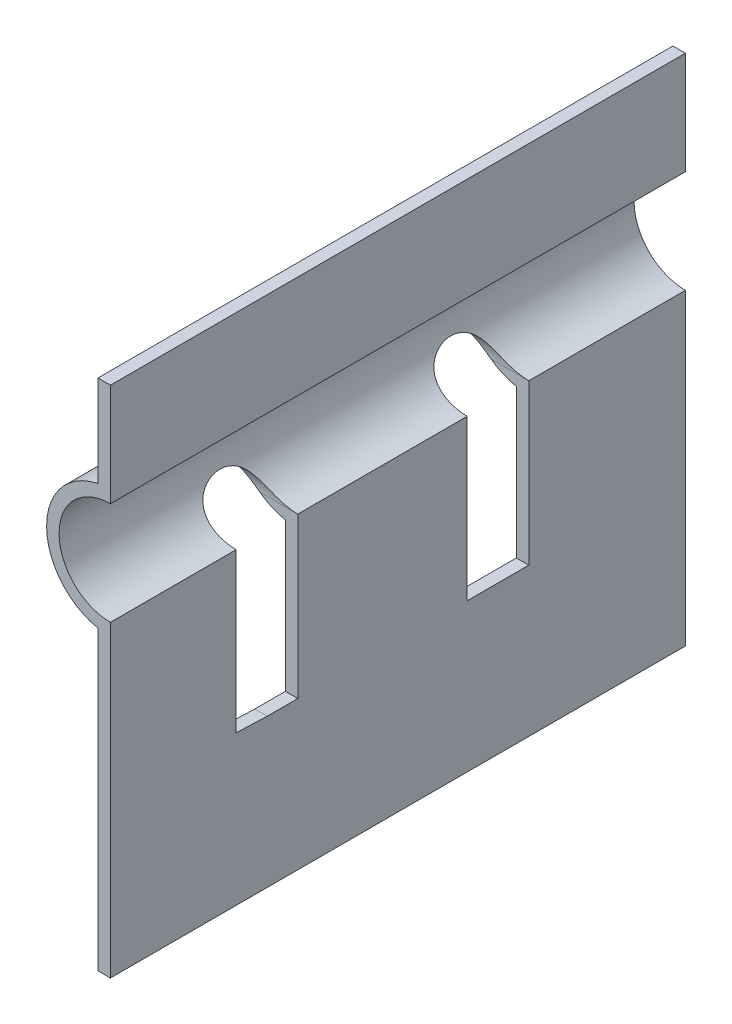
ISO-10303-21;
HEADER;
FILE_DESCRIPTION(('STEP AP214'),'2;1');
FILE_NAME('part.step','',(''),(''),'','','');
FILE_SCHEMA(('AUTOMOTIVE_DESIGN { 1 0 10303 214 1 1 1 1 }'));
ENDSEC;
DATA;
#1=APPLICATION_CONTEXT('core data for automotive mechanical design processes');
#2=APPLICATION_PROTOCOL_DEFINITION('international standard','automotive_design',2000,#1);
#3=PRODUCT_CONTEXT('',#1,'mechanical');
#4=PRODUCT('Part','Part','',(#3));
#5=PRODUCT_RELATED_PRODUCT_CATEGORY('part','',(#4));
#6=PRODUCT_DEFINITION_FORMATION('','',#4);
#7=PRODUCT_DEFINITION_CONTEXT('part definition',#1,'design');
#8=PRODUCT_DEFINITION('design','',#6,#7);
#9=PRODUCT_DEFINITION_SHAPE('','',#8);
#10=(LENGTH_UNIT() NAMED_UNIT(*) SI_UNIT(.MILLI.,.METRE.));
#11=(NAMED_UNIT(*) PLANE_ANGLE_UNIT() SI_UNIT($,.RADIAN.));
#12=(NAMED_UNIT(*) SI_UNIT($,.STERADIAN.) SOLID_ANGLE_UNIT());
#13=UNCERTAINTY_MEASURE_WITH_UNIT(LENGTH_MEASURE(1.E-05),#10,'distance_accuracy_value','');
#14=(GEOMETRIC_REPRESENTATION_CONTEXT(3) GLOBAL_UNCERTAINTY_ASSIGNED_CONTEXT((#13)) GLOBAL_UNIT_ASSIGNED_CONTEXT((#10,
#11,#12)) REPRESENTATION_CONTEXT('',''));
#15=CARTESIAN_POINT('',(0.,0.,0.));
#16=DIRECTION('',(0.,0.,1.));
#17=DIRECTION('',(1.,0.,0.));
#18=AXIS2_PLACEMENT_3D('',#15,#16,#17);
#19=CARTESIAN_POINT('',(-1.214,0.,56.));
#20=DIRECTION('',(0.,-1.,0.));
#21=DIRECTION('',(0.,0.,-1.));
#22=AXIS2_PLACEMENT_3D('',#19,#20,#21);
#23=PLANE('',#22);
#24=DIRECTION('',(-1.,0.,0.));
#25=VECTOR('',#24,1.);
#26=CARTESIAN_POINT('',(-1.214,0.,0.));
#27=LINE('',#26,#25);
#28=CARTESIAN_POINT('',(0.,0.,0.));
#29=VERTEX_POINT('',#28);
#30=CARTESIAN_POINT('',(-1.214,0.,0.));
#31=VERTEX_POINT('',#30);
#32=EDGE_CURVE('E257',#29,#31,#27,.T.);
#33=ORIENTED_EDGE('',*,*,#32,.T.);
#34=DIRECTION('',(0.,0.,-1.));
#35=VECTOR('',#34,1.);
#36=CARTESIAN_POINT('',(-1.214,0.,56.));
#37=LINE('',#36,#35);
#38=CARTESIAN_POINT('',(-1.214,0.,56.));
#39=VERTEX_POINT('',#38);
#40=EDGE_CURVE('E316',#39,#31,#37,.T.);
#41=ORIENTED_EDGE('',*,*,#40,.F.);
#42=DIRECTION('',(-1.,0.,0.));
#43=VECTOR('',#42,1.);
#44=CARTESIAN_POINT('',(-1.214,0.,56.));
#45=LINE('',#44,#43);
#46=CARTESIAN_POINT('',(0.,0.,56.));
#47=VERTEX_POINT('',#46);
#48=EDGE_CURVE('E258',#47,#39,#45,.T.);
#49=ORIENTED_EDGE('',*,*,#48,.F.);
#50=DIRECTION('',(0.,0.,-1.));
#51=VECTOR('',#50,1.);
#52=CARTESIAN_POINT('',(0.,0.,56.));
#53=LINE('',#52,#51);
#54=EDGE_CURVE('E276',#47,#29,#53,.T.);
#55=ORIENTED_EDGE('',*,*,#54,.T.);
#56=EDGE_LOOP('',(#33,#41,#49,#55));
#57=FACE_BOUND('',#56,.T.);
#58=ADVANCED_FACE('F31',(#57),#23,.F.);
#59=CARTESIAN_POINT('',(-1.214,0.,56.));
#60=DIRECTION('',(1.,0.,0.));
#61=DIRECTION('',(0.,1.,0.));
#62=AXIS2_PLACEMENT_3D('',#59,#60,#61);
#63=PLANE('',#62);
#64=DIRECTION('',(0.,-1.,0.));
#65=VECTOR('',#64,1.);
#66=CARTESIAN_POINT('',(-1.214,0.,0.));
#67=LINE('',#66,#65);
#68=CARTESIAN_POINT('',(-1.214,-8.90574040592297,0.));
#69=VERTEX_POINT('',#68);
#70=EDGE_CURVE('E279',#31,#69,#67,.T.);
#71=ORIENTED_EDGE('',*,*,#70,.T.);
#72=DIRECTION('',(0.,0.,-1.));
#73=VECTOR('',#72,1.);
#74=CARTESIAN_POINT('',(-1.214,-8.90574040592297,56.));
#75=LINE('',#74,#73);
#76=CARTESIAN_POINT('',(-1.214,-8.90574040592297,56.));
#77=VERTEX_POINT('',#76);
#78=EDGE_CURVE('E313',#77,#69,#75,.T.);
#79=ORIENTED_EDGE('',*,*,#78,.F.);
#80=DIRECTION('',(0.,-1.,0.));
#81=VECTOR('',#80,1.);
#82=CARTESIAN_POINT('',(-1.214,0.,56.));
#83=LINE('',#82,#81);
#84=EDGE_CURVE('E261',#39,#77,#83,.T.);
#85=ORIENTED_EDGE('',*,*,#84,.F.);
#86=ORIENTED_EDGE('',*,*,#40,.T.);
#87=EDGE_LOOP('',(#71,#79,#85,#86));
#88=FACE_BOUND('',#87,.T.);
#89=ADVANCED_FACE('F377',(#88),#63,.F.);
#90=CARTESIAN_POINT('',(0.,-15.,56.));
#91=DIRECTION('',(0.,0.,-1.));
#92=DIRECTION('',(-1.,0.,0.));
#93=AXIS2_PLACEMENT_3D('',#90,#91,#92);
#94=CYLINDRICAL_SURFACE('',#93,6.214);
#95=CARTESIAN_POINT('',(4.78600000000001,-18.9633319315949,37.9348056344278));
#96=CARTESIAN_POINT('',(4.74636962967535,-19.01119217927,37.917181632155));
#97=CARTESIAN_POINT('',(4.70575982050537,-19.0587656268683,37.9010490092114));
#98=CARTESIAN_POINT('',(4.62268893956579,-19.1531298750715,37.8715883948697));
#99=CARTESIAN_POINT('',(4.58022851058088,-19.1999209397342,37.8582594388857));
#100=CARTESIAN_POINT('',(4.45042022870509,-19.3386111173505,37.8222581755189));
#101=CARTESIAN_POINT('',(4.36043448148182,-19.4290827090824,37.803480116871));
#102=CARTESIAN_POINT('',(4.17539625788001,-19.6039001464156,37.7749593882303));
#103=CARTESIAN_POINT('',(4.08041299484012,-19.6883039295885,37.7651164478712));
#104=CARTESIAN_POINT('',(3.88511545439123,-19.8513784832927,37.7525672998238));
#105=CARTESIAN_POINT('',(3.78479740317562,-19.9300450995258,37.7498662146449));
#106=CARTESIAN_POINT('',(3.55283829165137,-20.1006767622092,37.7501801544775));
#107=CARTESIAN_POINT('',(3.41983319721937,-20.1907835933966,37.7548634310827));
#108=CARTESIAN_POINT('',(3.14754136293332,-20.3602720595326,37.77049535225));
#109=CARTESIAN_POINT('',(3.00825384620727,-20.4396523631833,37.7814447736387));
#110=CARTESIAN_POINT('',(2.72358624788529,-20.5876407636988,37.8071536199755));
#111=CARTESIAN_POINT('',(2.57818058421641,-20.6561964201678,37.8219307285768));
#112=CARTESIAN_POINT('',(2.2826278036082,-20.7817984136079,37.8529365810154));
#113=CARTESIAN_POINT('',(2.13248033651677,-20.8388438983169,37.8691654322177));
#114=CARTESIAN_POINT('',(1.8235877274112,-20.9426981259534,37.9014270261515));
#115=CARTESIAN_POINT('',(1.66471977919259,-20.9891487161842,37.9174393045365));
#116=CARTESIAN_POINT('',(1.34353680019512,-21.0692747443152,37.9467029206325));
#117=CARTESIAN_POINT('',(1.18122181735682,-21.102950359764,37.9599542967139));
#118=CARTESIAN_POINT('',(0.854536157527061,-21.1571831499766,37.9820067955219));
#119=CARTESIAN_POINT('',(0.690171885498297,-21.1777740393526,37.9908193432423));
#120=CARTESIAN_POINT('',(0.360120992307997,-21.2057662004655,38.0029354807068));
#121=CARTESIAN_POINT('',(0.194434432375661,-21.2131680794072,38.006239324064));
#122=CARTESIAN_POINT('',(-0.138898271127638,-21.2147079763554,38.0069202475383));
#123=CARTESIAN_POINT('',(-0.306545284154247,-21.2086942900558,38.004229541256));
#124=CARTESIAN_POINT('',(-0.640617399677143,-21.1831605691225,37.9931319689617));
#125=CARTESIAN_POINT('',(-0.807042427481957,-21.1636397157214,37.9847247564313));
#126=CARTESIAN_POINT('',(-1.13784068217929,-21.1112376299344,37.9632546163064));
#127=CARTESIAN_POINT('',(-1.30220847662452,-21.0783265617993,37.9501812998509));
#128=CARTESIAN_POINT('',(-1.62749290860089,-20.9994229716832,37.9210571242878));
#129=CARTESIAN_POINT('',(-1.78840951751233,-20.9534303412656,37.9050062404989));
#130=CARTESIAN_POINT('',(-2.10505290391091,-20.8489480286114,37.872107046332));
#131=CARTESIAN_POINT('',(-2.26080334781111,-20.7905284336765,37.8552636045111));
#132=CARTESIAN_POINT('',(-2.56727916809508,-20.6613187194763,37.823040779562));
#133=CARTESIAN_POINT('',(-2.71800383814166,-20.5905268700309,37.8076616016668));
#134=CARTESIAN_POINT('',(-3.01331165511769,-20.4370388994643,37.7809841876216));
#135=CARTESIAN_POINT('',(-3.15790539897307,-20.3543645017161,37.7696786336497));
#136=CARTESIAN_POINT('',(-3.44022929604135,-20.177482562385,37.7539396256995));
#137=CARTESIAN_POINT('',(-3.57796295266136,-20.0832809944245,37.749502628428));
#138=CARTESIAN_POINT('',(-3.79977687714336,-19.9180866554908,37.7504011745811));
#139=CARTESIAN_POINT('',(-3.88614137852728,-19.8501292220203,37.7529209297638));
#140=CARTESIAN_POINT('',(-4.05495513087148,-19.7099006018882,37.7632319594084));
#141=CARTESIAN_POINT('',(-4.13740546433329,-19.6376306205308,37.771021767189));
#142=CARTESIAN_POINT('',(-4.29784595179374,-19.4893468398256,37.7928320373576));
#143=CARTESIAN_POINT('',(-4.37584112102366,-19.4133374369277,37.8068453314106));
#144=CARTESIAN_POINT('',(-4.52695464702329,-19.2581913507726,37.8420723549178));
#145=CARTESIAN_POINT('',(-4.60007390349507,-19.1790552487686,37.8632847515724));
#146=CARTESIAN_POINT('',(-4.72801981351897,-19.0332665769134,37.9091989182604));
#147=CARTESIAN_POINT('',(-4.78374615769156,-18.966978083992,37.9325528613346));
#148=CARTESIAN_POINT('',(-4.8913029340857,-18.8335737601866,37.9851153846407));
#149=CARTESIAN_POINT('',(-4.94313420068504,-18.7664581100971,38.0143227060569));
#150=CARTESIAN_POINT('',(-5.04265787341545,-18.6321323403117,38.0789529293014));
#151=CARTESIAN_POINT('',(-5.09035007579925,-18.5649222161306,38.1143761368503));
#152=CARTESIAN_POINT('',(-5.18136544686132,-18.4312942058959,38.1916577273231));
#153=CARTESIAN_POINT('',(-5.22469074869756,-18.3648759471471,38.2335129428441));
#154=CARTESIAN_POINT('',(-5.30714424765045,-18.2332780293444,38.3240742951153));
#155=CARTESIAN_POINT('',(-5.34624180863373,-18.1681099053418,38.3728252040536));
#156=CARTESIAN_POINT('',(-5.41983265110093,-18.0404990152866,38.4768679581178));
#157=CARTESIAN_POINT('',(-5.45432796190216,-17.9780550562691,38.5321568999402));
#158=CARTESIAN_POINT('',(-5.51878533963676,-17.856837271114,38.649061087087));
#159=CARTESIAN_POINT('',(-5.54874687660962,-17.7980638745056,38.7106770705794));
#160=CARTESIAN_POINT('',(-5.60426838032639,-17.6851317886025,38.8398320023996));
#161=CARTESIAN_POINT('',(-5.62982876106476,-17.6309726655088,38.9073703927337));
#162=CARTESIAN_POINT('',(-5.67424059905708,-17.5336411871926,39.0402884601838));
#163=CARTESIAN_POINT('',(-5.69351776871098,-17.4899135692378,39.1051208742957));
#164=CARTESIAN_POINT('',(-5.72893032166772,-17.407316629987,39.2386566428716));
#165=CARTESIAN_POINT('',(-5.74506468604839,-17.3684488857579,39.3073612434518));
#166=CARTESIAN_POINT('',(-5.77437803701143,-17.2960578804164,39.4480965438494));
#167=CARTESIAN_POINT('',(-5.78755841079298,-17.2625321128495,39.5201256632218));
#168=CARTESIAN_POINT('',(-5.8111741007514,-17.2011645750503,39.6670090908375));
#169=CARTESIAN_POINT('',(-5.82160839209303,-17.173324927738,39.7418644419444));
#170=CARTESIAN_POINT('',(-5.84868333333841,-17.0998679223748,39.9666357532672));
#171=CARTESIAN_POINT('',(-5.8617158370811,-17.0627120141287,40.1198711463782));
#172=CARTESIAN_POINT('',(-5.87901131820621,-17.0128873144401,40.4306675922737));
#173=CARTESIAN_POINT('',(-5.88327406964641,-17.0002191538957,40.5882287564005));
#174=CARTESIAN_POINT('',(-5.88342283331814,-16.9997843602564,40.9050946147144));
#175=CARTESIAN_POINT('',(-5.87921917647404,-17.0122842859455,41.0644000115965));
#176=CARTESIAN_POINT('',(-5.86186927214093,-17.0622741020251,41.3785430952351));
#177=CARTESIAN_POINT('',(-5.84872285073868,-17.0997644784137,41.5333806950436));
#178=CARTESIAN_POINT('',(-5.81239928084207,-17.1983065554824,41.8342397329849));
#179=CARTESIAN_POINT('',(-5.78921631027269,-17.2593719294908,41.9802559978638));
#180=CARTESIAN_POINT('',(-5.73130439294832,-17.4024717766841,42.2591029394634));
#181=CARTESIAN_POINT('',(-5.69657795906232,-17.484501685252,42.3919364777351));
#182=CARTESIAN_POINT('',(-5.61448929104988,-17.6647646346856,42.6394068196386));
#183=CARTESIAN_POINT('',(-5.56726651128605,-17.762814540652,42.7542234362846));
#184=CARTESIAN_POINT('',(-5.45900285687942,-17.9709946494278,42.964735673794));
#185=CARTESIAN_POINT('',(-5.39796332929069,-18.0811236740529,43.0604331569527));
#186=CARTESIAN_POINT('',(-5.26111919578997,-18.3094275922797,43.2324660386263));
#187=CARTESIAN_POINT('',(-5.18515975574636,-18.4276775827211,43.3085771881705));
#188=CARTESIAN_POINT('',(-5.01955743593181,-18.6659062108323,43.4404936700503));
#189=CARTESIAN_POINT('',(-4.9299089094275,-18.7858855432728,43.4962905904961));
#190=CARTESIAN_POINT('',(-4.76914609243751,-18.9849478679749,43.5743885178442));
#191=CARTESIAN_POINT('',(-4.7013139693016,-19.0648011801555,43.6016926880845));
#192=CARTESIAN_POINT('',(-4.56046695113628,-19.2222126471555,43.6485836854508));
#193=CARTESIAN_POINT('',(-4.48745053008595,-19.2997701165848,43.6681682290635));
#194=CARTESIAN_POINT('',(-4.33666151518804,-19.4518143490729,43.700516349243));
#195=CARTESIAN_POINT('',(-4.25888203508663,-19.5262963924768,43.7132697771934));
#196=CARTESIAN_POINT('',(-4.09913287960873,-19.6714626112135,43.7328558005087));
#197=CARTESIAN_POINT('',(-4.01716200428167,-19.7421456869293,43.7396866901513));
#198=CARTESIAN_POINT('',(-3.81636248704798,-19.9063204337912,43.7500680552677));
#199=CARTESIAN_POINT('',(-3.6957601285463,-19.9977983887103,43.7512583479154));
#200=CARTESIAN_POINT('',(-3.44829591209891,-20.1716483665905,43.7463484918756));
#201=CARTESIAN_POINT('',(-3.32143149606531,-20.2540166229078,43.7402453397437));
#202=CARTESIAN_POINT('',(-3.06211818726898,-20.4092604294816,43.7229805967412));
#203=CARTESIAN_POINT('',(-2.92966131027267,-20.4821217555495,43.7118115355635));
#204=CARTESIAN_POINT('',(-2.66004958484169,-20.6178924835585,43.6864906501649));
#205=CARTESIAN_POINT('',(-2.52289514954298,-20.6808027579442,43.6723390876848));
#206=CARTESIAN_POINT('',(-2.23935954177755,-20.7985763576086,43.6424216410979));
#207=CARTESIAN_POINT('',(-2.09282451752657,-20.8530590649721,43.6266155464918));
#208=CARTESIAN_POINT('',(-1.79598748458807,-20.9508523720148,43.5957881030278));
#209=CARTESIAN_POINT('',(-1.64568541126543,-20.9941627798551,43.5807667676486));
#210=CARTESIAN_POINT('',(-1.34224307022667,-21.0693138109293,43.5532428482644));
#211=CARTESIAN_POINT('',(-1.18910736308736,-21.1011714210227,43.5407365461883));
#212=CARTESIAN_POINT('',(-0.880600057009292,-21.1532765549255,43.5196109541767));
#213=CARTESIAN_POINT('',(-0.725228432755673,-21.1735239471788,43.5109917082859));
#214=CARTESIAN_POINT('',(-0.397581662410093,-21.2036617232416,43.4980002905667));
#215=CARTESIAN_POINT('',(-0.225169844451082,-21.2123139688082,43.4941390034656));
#216=CARTESIAN_POINT('',(0.119808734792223,-21.2152394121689,43.4928441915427));
#217=CARTESIAN_POINT('',(0.29237550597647,-21.2095116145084,43.4954111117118));
#218=CARTESIAN_POINT('',(0.636428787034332,-21.1837327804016,43.5066231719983));
#219=CARTESIAN_POINT('',(0.807913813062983,-21.1636651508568,43.5152753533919));
#220=CARTESIAN_POINT('',(1.14829888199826,-21.1094117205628,43.5374826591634));
#221=CARTESIAN_POINT('',(1.3171989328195,-21.0752259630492,43.5510377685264));
#222=CARTESIAN_POINT('',(1.64191663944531,-20.9953544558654,43.5803655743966));
#223=CARTESIAN_POINT('',(1.79793618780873,-20.9504226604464,43.595970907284));
#224=CARTESIAN_POINT('',(2.10591728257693,-20.8485227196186,43.6279958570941));
#225=CARTESIAN_POINT('',(2.25787860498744,-20.7915539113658,43.6444155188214));
#226=CARTESIAN_POINT('',(2.55702444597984,-20.6658407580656,43.6758938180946));
#227=CARTESIAN_POINT('',(2.70420827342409,-20.5970947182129,43.6909522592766));
#228=CARTESIAN_POINT('',(2.99298969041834,-20.4481358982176,43.7173040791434));
#229=CARTESIAN_POINT('',(3.13458889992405,-20.3679264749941,43.7285985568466));
#230=CARTESIAN_POINT('',(3.37874313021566,-20.2166450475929,43.7428911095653));
#231=CARTESIAN_POINT('',(3.48264411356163,-20.1478652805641,43.7472161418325));
#232=CARTESIAN_POINT('',(3.68617245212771,-20.0041420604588,43.7508580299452));
#233=CARTESIAN_POINT('',(3.78580092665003,-19.9292002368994,43.7501762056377));
#234=CARTESIAN_POINT('',(3.97988299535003,-19.7738579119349,43.7424714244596));
#235=CARTESIAN_POINT('',(4.07435400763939,-19.6934781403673,43.7354714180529));
#236=CARTESIAN_POINT('',(4.25780389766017,-19.5277109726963,43.7137683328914));
#237=CARTESIAN_POINT('',(4.34678635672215,-19.4423269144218,43.6990703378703));
#238=CARTESIAN_POINT('',(4.49495467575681,-19.2915116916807,43.6658628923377));
#239=CARTESIAN_POINT('',(4.55560904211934,-19.2270453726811,43.6495108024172));
#240=CARTESIAN_POINT('',(4.67348448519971,-19.0963563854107,43.6114802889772));
#241=CARTESIAN_POINT('',(4.73069936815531,-19.0301308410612,43.5897925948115));
#242=CARTESIAN_POINT('',(4.78600000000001,-18.9633319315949,43.5651943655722));
#243=B_SPLINE_CURVE_WITH_KNOTS('',3,(#95,#96,#97,#98,#99,#100,#101,#102,#103,#104,#105,#106,
#107,#108,#109,#110,#111,#112,#113,#114,#115,#116,#117,#118,#119,#120,#121,#122,#123,#124,#125,
#126,#127,#128,#129,#130,#131,#132,#133,#134,#135,#136,#137,#138,#139,#140,#141,#142,#143,#144,
#145,#146,#147,#148,#149,#150,#151,#152,#153,#154,#155,#156,#157,#158,#159,#160,#161,#162,#163,
#164,#165,#166,#167,#168,#169,#170,#171,#172,#173,#174,#175,#176,#177,#178,#179,#180,#181,#182,
#183,#184,#185,#186,#187,#188,#189,#190,#191,#192,#193,#194,#195,#196,#197,#198,#199,#200,#201,
#202,#203,#204,#205,#206,#207,#208,#209,#210,#211,#212,#213,#214,#215,#216,#217,#218,#219,#220,
#221,#222,#223,#224,#225,#226,#227,#228,#229,#230,#231,#232,#233,#234,#235,#236,#237,#238,#239,
#240,#241,#242),.UNSPECIFIED.,.F.,.F.,(4,2,2,2,2,2,2,2,2,2,2,2,2,2,2,2,2,2,2,2,2,2,2,2,2,2,2,2,
2,2,2,2,2,2,2,2,2,2,2,2,2,2,2,2,2,2,2,2,2,2,2,2,2,2,2,2,2,2,2,2,2,2,2,2,2,2,2,2,2,2,2,2,2,4),
(0.,0.193710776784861,0.387354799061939,0.77361694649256,1.15548883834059,1.53763455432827,
2.01910968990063,2.50064452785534,2.98444498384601,3.46828124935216,3.96662231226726,
4.46495644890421,4.96200129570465,5.45902325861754,5.96169404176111,6.46439529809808,
6.9682228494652,7.4720545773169,7.97311669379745,8.47424893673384,8.97447640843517,
9.47444574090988,9.80397811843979,10.1334188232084,10.4624810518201,10.7914823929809,
11.0603089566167,11.3290777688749,11.5978598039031,11.8665099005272,12.1369920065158,
12.4073544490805,12.6777484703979,12.9481170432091,13.1894465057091,13.4308540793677,
13.6721480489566,13.9135319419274,14.3857692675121,14.8580187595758,15.3352962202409,
15.812582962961,16.2901469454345,16.7676070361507,17.239948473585,17.712243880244,
18.1897276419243,18.6674088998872,18.9918257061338,19.3163384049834,19.6413318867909,
19.9664189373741,20.419864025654,20.8734959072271,21.3277989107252,21.7820620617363,
22.2530168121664,22.7239796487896,23.1942410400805,23.6645077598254,24.1817999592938,
24.6991279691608,25.2170555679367,25.7349815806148,26.2238109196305,26.7126671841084,
27.2015938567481,27.6903776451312,28.0641268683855,28.4377775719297,28.8100764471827,
29.1821297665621,29.451941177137,29.7222247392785),.UNSPECIFIED.);
#244=CARTESIAN_POINT('',(-3.68968779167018,-20.,37.75));
#245=VERTEX_POINT('',#244);
#246=CARTESIAN_POINT('',(-3.68968779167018,-20.,43.75));
#247=VERTEX_POINT('',#246);
#248=EDGE_CURVE('E200',#245,#247,#243,.T.);
#249=ORIENTED_EDGE('',*,*,#248,.T.);
#250=CARTESIAN_POINT('',(0.,-15.,43.75));
#251=DIRECTION('',(0.,0.,1.));
#252=DIRECTION('',(0.,-1.,0.));
#253=AXIS2_PLACEMENT_3D('',#250,#251,#252);
#254=CIRCLE('',#253,6.214);
#255=CARTESIAN_POINT('',(-1.214,-21.094259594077,43.75));
#256=VERTEX_POINT('',#255);
#257=EDGE_CURVE('E356',#247,#256,#254,.T.);
#258=ORIENTED_EDGE('',*,*,#257,.T.);
#259=DIRECTION('',(0.,0.,-1.));
#260=VECTOR('',#259,1.);
#261=CARTESIAN_POINT('',(-1.214,-21.094259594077,56.));
#262=LINE('',#261,#260);
#263=CARTESIAN_POINT('',(-1.214,-21.094259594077,56.));
#264=VERTEX_POINT('',#263);
#265=EDGE_CURVE('E310',#264,#256,#262,.T.);
#266=ORIENTED_EDGE('',*,*,#265,.F.);
#267=CARTESIAN_POINT('',(0.,-15.,56.));
#268=DIRECTION('',(0.,0.,1.));
#269=DIRECTION('',(1.,0.,0.));
#270=AXIS2_PLACEMENT_3D('',#267,#268,#269);
#271=CIRCLE('',#270,6.214);
#272=EDGE_CURVE('E264',#77,#264,#271,.T.);
#273=ORIENTED_EDGE('',*,*,#272,.F.);
#274=ORIENTED_EDGE('',*,*,#78,.T.);
#275=CARTESIAN_POINT('',(0.,-15.,0.));
#276=DIRECTION('',(0.,0.,1.));
#277=DIRECTION('',(1.,0.,0.));
#278=AXIS2_PLACEMENT_3D('',#275,#276,#277);
#279=CIRCLE('',#278,6.214);
#280=CARTESIAN_POINT('',(-1.214,-21.094259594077,0.));
#281=VERTEX_POINT('',#280);
#282=EDGE_CURVE('E281',#69,#281,#279,.T.);
#283=ORIENTED_EDGE('',*,*,#282,.T.);
#284=CARTESIAN_POINT('',(-1.214,-21.094259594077,15.25));
#285=VERTEX_POINT('',#284);
#286=EDGE_CURVE('E309',#285,#281,#262,.T.);
#287=ORIENTED_EDGE('',*,*,#286,.F.);
#288=CARTESIAN_POINT('',(0.,-15.,15.25));
#289=DIRECTION('',(0.,0.,-1.));
#290=DIRECTION('',(-1.,0.,0.));
#291=AXIS2_PLACEMENT_3D('',#288,#289,#290);
#292=CIRCLE('',#291,6.214);
#293=CARTESIAN_POINT('',(-3.68968779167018,-20.,15.25));
#294=VERTEX_POINT('',#293);
#295=EDGE_CURVE('E247',#285,#294,#292,.T.);
#296=ORIENTED_EDGE('',*,*,#295,.T.);
#297=CARTESIAN_POINT('',(4.786,-18.9633319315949,15.4348056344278));
#298=CARTESIAN_POINT('',(4.74636962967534,-19.0111921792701,15.417181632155));
#299=CARTESIAN_POINT('',(4.70575982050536,-19.0587656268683,15.4010490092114));
#300=CARTESIAN_POINT('',(4.62268893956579,-19.1531298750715,15.3715883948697));
#301=CARTESIAN_POINT('',(4.58022851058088,-19.1999209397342,15.3582594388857));
#302=CARTESIAN_POINT('',(4.45042022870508,-19.3386111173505,15.3222581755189));
#303=CARTESIAN_POINT('',(4.36043448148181,-19.4290827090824,15.303480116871));
#304=CARTESIAN_POINT('',(4.17539625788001,-19.6039001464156,15.2749593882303));
#305=CARTESIAN_POINT('',(4.08041299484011,-19.6883039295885,15.2651164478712));
#306=CARTESIAN_POINT('',(3.88511545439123,-19.8513784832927,15.2525672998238));
#307=CARTESIAN_POINT('',(3.78479740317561,-19.9300450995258,15.2498662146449));
#308=CARTESIAN_POINT('',(3.55283829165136,-20.1006767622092,15.2501801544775));
#309=CARTESIAN_POINT('',(3.41983319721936,-20.1907835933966,15.2548634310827));
#310=CARTESIAN_POINT('',(3.14754136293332,-20.3602720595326,15.27049535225));
#311=CARTESIAN_POINT('',(3.00825384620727,-20.4396523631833,15.2814447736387));
#312=CARTESIAN_POINT('',(2.72358624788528,-20.5876407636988,15.3071536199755));
#313=CARTESIAN_POINT('',(2.57818058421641,-20.6561964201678,15.3219307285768));
#314=CARTESIAN_POINT('',(2.28262780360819,-20.7817984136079,15.3529365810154));
#315=CARTESIAN_POINT('',(2.13248033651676,-20.8388438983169,15.3691654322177));
#316=CARTESIAN_POINT('',(1.82358772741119,-20.9426981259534,15.4014270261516));
#317=CARTESIAN_POINT('',(1.66471977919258,-20.9891487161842,15.4174393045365));
#318=CARTESIAN_POINT('',(1.34353680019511,-21.0692747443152,15.4467029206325));
#319=CARTESIAN_POINT('',(1.18122181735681,-21.102950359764,15.4599542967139));
#320=CARTESIAN_POINT('',(0.854536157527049,-21.1571831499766,15.4820067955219));
#321=CARTESIAN_POINT('',(0.690171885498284,-21.1777740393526,15.4908193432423));
#322=CARTESIAN_POINT('',(0.360120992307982,-21.2057662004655,15.5029354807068));
#323=CARTESIAN_POINT('',(0.194434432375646,-21.2131680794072,15.506239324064));
#324=CARTESIAN_POINT('',(-0.138898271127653,-21.2147079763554,15.5069202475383));
#325=CARTESIAN_POINT('',(-0.306545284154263,-21.2086942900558,15.504229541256));
#326=CARTESIAN_POINT('',(-0.640617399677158,-21.1831605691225,15.4931319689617));
#327=CARTESIAN_POINT('',(-0.807042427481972,-21.1636397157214,15.4847247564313));
#328=CARTESIAN_POINT('',(-1.1378406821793,-21.1112376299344,15.4632546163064));
#329=CARTESIAN_POINT('',(-1.30220847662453,-21.0783265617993,15.4501812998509));
#330=CARTESIAN_POINT('',(-1.6274929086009,-20.9994229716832,15.4210571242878));
#331=CARTESIAN_POINT('',(-1.78840951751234,-20.9534303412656,15.4050062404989));
#332=CARTESIAN_POINT('',(-2.10505290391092,-20.8489480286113,15.372107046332));
#333=CARTESIAN_POINT('',(-2.26080334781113,-20.7905284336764,15.3552636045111));
#334=CARTESIAN_POINT('',(-2.56727916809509,-20.6613187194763,15.323040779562));
#335=CARTESIAN_POINT('',(-2.71800383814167,-20.5905268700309,15.3076616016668));
#336=CARTESIAN_POINT('',(-3.0133116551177,-20.4370388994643,15.2809841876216));
#337=CARTESIAN_POINT('',(-3.15790539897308,-20.3543645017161,15.2696786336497));
#338=CARTESIAN_POINT('',(-3.44022929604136,-20.177482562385,15.2539396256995));
#339=CARTESIAN_POINT('',(-3.57796295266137,-20.0832809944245,15.249502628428));
#340=CARTESIAN_POINT('',(-3.79977687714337,-19.9180866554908,15.2504011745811));
#341=CARTESIAN_POINT('',(-3.8861413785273,-19.8501292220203,15.2529209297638));
#342=CARTESIAN_POINT('',(-4.05495513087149,-19.7099006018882,15.2632319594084));
#343=CARTESIAN_POINT('',(-4.1374054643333,-19.6376306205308,15.271021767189));
#344=CARTESIAN_POINT('',(-4.29784595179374,-19.4893468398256,15.2928320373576));
#345=CARTESIAN_POINT('',(-4.37584112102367,-19.4133374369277,15.3068453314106));
#346=CARTESIAN_POINT('',(-4.5269546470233,-19.2581913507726,15.3420723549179));
#347=CARTESIAN_POINT('',(-4.60007390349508,-19.1790552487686,15.3632847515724));
#348=CARTESIAN_POINT('',(-4.72801981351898,-19.0332665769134,15.4091989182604));
#349=CARTESIAN_POINT('',(-4.78374615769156,-18.9669780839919,15.4325528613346));
#350=CARTESIAN_POINT('',(-4.89130293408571,-18.8335737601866,15.4851153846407));
#351=CARTESIAN_POINT('',(-4.94313420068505,-18.7664581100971,15.5143227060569));
#352=CARTESIAN_POINT('',(-5.04265787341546,-18.6321323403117,15.5789529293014));
#353=CARTESIAN_POINT('',(-5.09035007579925,-18.5649222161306,15.6143761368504));
#354=CARTESIAN_POINT('',(-5.18136544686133,-18.4312942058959,15.6916577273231));
#355=CARTESIAN_POINT('',(-5.22469074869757,-18.3648759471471,15.7335129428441));
#356=CARTESIAN_POINT('',(-5.30714424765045,-18.2332780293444,15.8240742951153));
#357=CARTESIAN_POINT('',(-5.34624180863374,-18.1681099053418,15.8728252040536));
#358=CARTESIAN_POINT('',(-5.41983265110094,-18.0404990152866,15.9768679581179));
#359=CARTESIAN_POINT('',(-5.45432796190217,-17.9780550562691,16.0321568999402));
#360=CARTESIAN_POINT('',(-5.51878533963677,-17.856837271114,16.1490610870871));
#361=CARTESIAN_POINT('',(-5.54874687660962,-17.7980638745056,16.2106770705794));
#362=CARTESIAN_POINT('',(-5.60426838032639,-17.6851317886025,16.3398320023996));
#363=CARTESIAN_POINT('',(-5.62982876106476,-17.6309726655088,16.4073703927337));
#364=CARTESIAN_POINT('',(-5.67424059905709,-17.5336411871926,16.5402884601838));
#365=CARTESIAN_POINT('',(-5.69351776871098,-17.4899135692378,16.6051208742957));
#366=CARTESIAN_POINT('',(-5.72893032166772,-17.407316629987,16.7386566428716));
#367=CARTESIAN_POINT('',(-5.74506468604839,-17.3684488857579,16.8073612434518));
#368=CARTESIAN_POINT('',(-5.77437803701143,-17.2960578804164,16.9480965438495));
#369=CARTESIAN_POINT('',(-5.78755841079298,-17.2625321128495,17.0201256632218));
#370=CARTESIAN_POINT('',(-5.8111741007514,-17.2011645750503,17.1670090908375));
#371=CARTESIAN_POINT('',(-5.82160839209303,-17.173324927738,17.2418644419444));
#372=CARTESIAN_POINT('',(-5.84868333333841,-17.0998679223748,17.4666357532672));
#373=CARTESIAN_POINT('',(-5.8617158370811,-17.0627120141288,17.6198711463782));
#374=CARTESIAN_POINT('',(-5.87901131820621,-17.0128873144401,17.9306675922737));
#375=CARTESIAN_POINT('',(-5.88327406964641,-17.0002191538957,18.0882287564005));
#376=CARTESIAN_POINT('',(-5.88342283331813,-16.9997843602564,18.4050946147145));
#377=CARTESIAN_POINT('',(-5.87921917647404,-17.0122842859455,18.5644000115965));
#378=CARTESIAN_POINT('',(-5.86186927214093,-17.0622741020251,18.8785430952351));
#379=CARTESIAN_POINT('',(-5.84872285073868,-17.0997644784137,19.0333806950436));
#380=CARTESIAN_POINT('',(-5.81239928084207,-17.1983065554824,19.3342397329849));
#381=CARTESIAN_POINT('',(-5.78921631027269,-17.2593719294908,19.4802559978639));
#382=CARTESIAN_POINT('',(-5.73130439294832,-17.4024717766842,19.7591029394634));
#383=CARTESIAN_POINT('',(-5.69657795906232,-17.484501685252,19.8919364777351));
#384=CARTESIAN_POINT('',(-5.61448929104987,-17.6647646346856,20.1394068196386));
#385=CARTESIAN_POINT('',(-5.56726651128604,-17.762814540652,20.2542234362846));
#386=CARTESIAN_POINT('',(-5.45900285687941,-17.9709946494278,20.464735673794));
#387=CARTESIAN_POINT('',(-5.39796332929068,-18.0811236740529,20.5604331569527));
#388=CARTESIAN_POINT('',(-5.26111919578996,-18.3094275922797,20.7324660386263));
#389=CARTESIAN_POINT('',(-5.18515975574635,-18.4276775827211,20.8085771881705));
#390=CARTESIAN_POINT('',(-5.0195574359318,-18.6659062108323,20.9404936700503));
#391=CARTESIAN_POINT('',(-4.92990890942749,-18.7858855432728,20.9962905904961));
#392=CARTESIAN_POINT('',(-4.7691460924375,-18.9849478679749,21.0743885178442));
#393=CARTESIAN_POINT('',(-4.70131396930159,-19.0648011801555,21.1016926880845));
#394=CARTESIAN_POINT('',(-4.56046695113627,-19.2222126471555,21.1485836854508));
#395=CARTESIAN_POINT('',(-4.48745053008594,-19.2997701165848,21.1681682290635));
#396=CARTESIAN_POINT('',(-4.33666151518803,-19.4518143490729,21.200516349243));
#397=CARTESIAN_POINT('',(-4.25888203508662,-19.5262963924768,21.2132697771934));
#398=CARTESIAN_POINT('',(-4.09913287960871,-19.6714626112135,21.2328558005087));
#399=CARTESIAN_POINT('',(-4.01716200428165,-19.7421456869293,21.2396866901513));
#400=CARTESIAN_POINT('',(-3.81636248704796,-19.9063204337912,21.2500680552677));
#401=CARTESIAN_POINT('',(-3.69576012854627,-19.9977983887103,21.2512583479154));
#402=CARTESIAN_POINT('',(-3.44829591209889,-20.1716483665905,21.2463484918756));
#403=CARTESIAN_POINT('',(-3.32143149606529,-20.2540166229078,21.2402453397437));
#404=CARTESIAN_POINT('',(-3.06211818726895,-20.4092604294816,21.2229805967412));
#405=CARTESIAN_POINT('',(-2.92966131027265,-20.4821217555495,21.2118115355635));
#406=CARTESIAN_POINT('',(-2.66004958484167,-20.6178924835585,21.1864906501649));
#407=CARTESIAN_POINT('',(-2.52289514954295,-20.6808027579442,21.1723390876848));
#408=CARTESIAN_POINT('',(-2.23935954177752,-20.7985763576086,21.1424216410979));
#409=CARTESIAN_POINT('',(-2.09282451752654,-20.8530590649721,21.1266155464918));
#410=CARTESIAN_POINT('',(-1.79598748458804,-20.9508523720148,21.0957881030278));
#411=CARTESIAN_POINT('',(-1.6456854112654,-20.9941627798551,21.0807667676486));
#412=CARTESIAN_POINT('',(-1.34224307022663,-21.0693138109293,21.0532428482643));
#413=CARTESIAN_POINT('',(-1.18910736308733,-21.1011714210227,21.0407365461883));
#414=CARTESIAN_POINT('',(-0.880600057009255,-21.1532765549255,21.0196109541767));
#415=CARTESIAN_POINT('',(-0.725228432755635,-21.1735239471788,21.0109917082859));
#416=CARTESIAN_POINT('',(-0.397581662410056,-21.2036617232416,20.9980002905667));
#417=CARTESIAN_POINT('',(-0.225169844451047,-21.2123139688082,20.9941390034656));
#418=CARTESIAN_POINT('',(0.119808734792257,-21.2152394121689,20.9928441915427));
#419=CARTESIAN_POINT('',(0.292375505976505,-21.2095116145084,20.9954111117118));
#420=CARTESIAN_POINT('',(0.636428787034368,-21.1837327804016,21.0066231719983));
#421=CARTESIAN_POINT('',(0.807913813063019,-21.1636651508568,21.0152753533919));
#422=CARTESIAN_POINT('',(1.14829888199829,-21.1094117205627,21.0374826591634));
#423=CARTESIAN_POINT('',(1.31719893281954,-21.0752259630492,21.0510377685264));
#424=CARTESIAN_POINT('',(1.64191663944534,-20.9953544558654,21.0803655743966));
#425=CARTESIAN_POINT('',(1.79793618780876,-20.9504226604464,21.095970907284));
#426=CARTESIAN_POINT('',(2.10591728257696,-20.8485227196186,21.1279958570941));
#427=CARTESIAN_POINT('',(2.25787860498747,-20.7915539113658,21.1444155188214));
#428=CARTESIAN_POINT('',(2.55702444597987,-20.6658407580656,21.1758938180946));
#429=CARTESIAN_POINT('',(2.70420827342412,-20.5970947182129,21.1909522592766));
#430=CARTESIAN_POINT('',(2.99298969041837,-20.4481358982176,21.2173040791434));
#431=CARTESIAN_POINT('',(3.13458889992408,-20.367926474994,21.2285985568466));
#432=CARTESIAN_POINT('',(3.37874313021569,-20.2166450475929,21.2428911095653));
#433=CARTESIAN_POINT('',(3.48264411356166,-20.1478652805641,21.2472161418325));
#434=CARTESIAN_POINT('',(3.68617245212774,-20.0041420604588,21.2508580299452));
#435=CARTESIAN_POINT('',(3.78580092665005,-19.9292002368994,21.2501762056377));
#436=CARTESIAN_POINT('',(3.97988299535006,-19.7738579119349,21.2424714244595));
#437=CARTESIAN_POINT('',(4.07435400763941,-19.6934781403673,21.2354714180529));
#438=CARTESIAN_POINT('',(4.2578038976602,-19.5277109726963,21.2137683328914));
#439=CARTESIAN_POINT('',(4.34678635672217,-19.4423269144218,21.1990703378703));
#440=CARTESIAN_POINT('',(4.49495467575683,-19.2915116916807,21.1658628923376));
#441=CARTESIAN_POINT('',(4.55560904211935,-19.2270453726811,21.1495108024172));
#442=CARTESIAN_POINT('',(4.67348448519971,-19.0963563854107,21.1114802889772));
#443=CARTESIAN_POINT('',(4.73069936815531,-19.0301308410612,21.0897925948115));
#444=CARTESIAN_POINT('',(4.786,-18.9633319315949,21.0651943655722));
#445=B_SPLINE_CURVE_WITH_KNOTS('',3,(#297,#298,#299,#300,#301,#302,#303,#304,#305,#306,#307,
#308,#309,#310,#311,#312,#313,#314,#315,#316,#317,#318,#319,#320,#321,#322,#323,#324,#325,#326,
#327,#328,#329,#330,#331,#332,#333,#334,#335,#336,#337,#338,#339,#340,#341,#342,#343,#344,#345,
#346,#347,#348,#349,#350,#351,#352,#353,#354,#355,#356,#357,#358,#359,#360,#361,#362,#363,#364,
#365,#366,#367,#368,#369,#370,#371,#372,#373,#374,#375,#376,#377,#378,#379,#380,#381,#382,#383,
#384,#385,#386,#387,#388,#389,#390,#391,#392,#393,#394,#395,#396,#397,#398,#399,#400,#401,#402,
#403,#404,#405,#406,#407,#408,#409,#410,#411,#412,#413,#414,#415,#416,#417,#418,#419,#420,#421,
#422,#423,#424,#425,#426,#427,#428,#429,#430,#431,#432,#433,#434,#435,#436,#437,#438,#439,#440,
#441,#442,#443,#444),.UNSPECIFIED.,.F.,.F.,(4,2,2,2,2,2,2,2,2,2,2,2,2,2,2,2,2,2,2,2,2,2,2,2,2,2,
2,2,2,2,2,2,2,2,2,2,2,2,2,2,2,2,2,2,2,2,2,2,2,2,2,2,2,2,2,2,2,2,2,2,2,2,2,2,2,2,2,2,2,2,2,2,2,
4),(0.,0.193710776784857,0.387354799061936,0.773616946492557,1.15548883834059,1.53763455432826,
2.01910968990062,2.50064452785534,2.98444498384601,3.46828124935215,3.96662231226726,
4.46495644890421,4.96200129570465,5.45902325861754,5.96169404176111,6.46439529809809,
6.9682228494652,7.4720545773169,7.97311669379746,8.47424893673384,8.97447640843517,
9.47444574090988,9.80397811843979,10.1334188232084,10.4624810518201,10.7914823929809,
11.0603089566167,11.3290777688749,11.5978598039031,11.8665099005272,12.1369920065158,
12.4073544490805,12.6777484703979,12.9481170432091,13.1894465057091,13.4308540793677,
13.6721480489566,13.9135319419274,14.3857692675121,14.8580187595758,15.3352962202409,
15.812582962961,16.2901469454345,16.7676070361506,17.239948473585,17.712243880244,
18.1897276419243,18.6674088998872,18.9918257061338,19.3163384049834,19.6413318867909,
19.9664189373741,20.419864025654,20.8734959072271,21.3277989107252,21.7820620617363,
22.2530168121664,22.7239796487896,23.1942410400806,23.6645077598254,24.1817999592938,
24.6991279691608,25.2170555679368,25.7349815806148,26.2238109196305,26.7126671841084,
27.2015938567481,27.6903776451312,28.0641268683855,28.4377775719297,28.8100764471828,
29.1821297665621,29.451941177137,29.7222247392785),.UNSPECIFIED.);
#446=CARTESIAN_POINT('',(-3.68968779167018,-20.,21.25));
#447=VERTEX_POINT('',#446);
#448=EDGE_CURVE('E239',#294,#447,#445,.T.);
#449=ORIENTED_EDGE('',*,*,#448,.T.);
#450=CARTESIAN_POINT('',(0.,-15.,21.25));
#451=DIRECTION('',(0.,0.,1.));
#452=DIRECTION('',(1.,0.,0.));
#453=AXIS2_PLACEMENT_3D('',#450,#451,#452);
#454=CIRCLE('',#453,6.214);
#455=CARTESIAN_POINT('',(-1.214,-21.094259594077,21.25));
#456=VERTEX_POINT('',#455);
#457=EDGE_CURVE('E251',#447,#456,#454,.T.);
#458=ORIENTED_EDGE('',*,*,#457,.T.);
#459=CARTESIAN_POINT('',(-1.214,-21.094259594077,37.75));
#460=VERTEX_POINT('',#459);
#461=EDGE_CURVE('E314',#460,#456,#262,.T.);
#462=ORIENTED_EDGE('',*,*,#461,.F.);
#463=CARTESIAN_POINT('',(0.,-15.,37.75));
#464=DIRECTION('',(0.,0.,-1.));
#465=DIRECTION('',(-1.,0.,0.));
#466=AXIS2_PLACEMENT_3D('',#463,#464,#465);
#467=CIRCLE('',#466,6.214);
#468=EDGE_CURVE('E49',#460,#245,#467,.T.);
#469=ORIENTED_EDGE('',*,*,#468,.T.);
#470=EDGE_LOOP('',(#249,#258,#266,#273,#274,#283,#287,#296,#449,#458,#462,#469));
#471=FACE_BOUND('',#470,.T.);
#472=ADVANCED_FACE('F209',(#471),#94,.T.);
#473=CARTESIAN_POINT('',(-1.214,-21.094259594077,56.));
#474=DIRECTION('',(1.,0.,0.));
#475=DIRECTION('',(0.,1.,0.));
#476=AXIS2_PLACEMENT_3D('',#473,#474,#475);
#477=PLANE('',#476);
#478=ORIENTED_EDGE('',*,*,#265,.T.);
#479=DIRECTION('',(0.,-1.,0.));
#480=VECTOR('',#479,1.);
#481=CARTESIAN_POINT('',(-1.214,-21.094259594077,43.75));
#482=LINE('',#481,#480);
#483=CARTESIAN_POINT('',(-1.214,-35.444714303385,43.75));
#484=VERTEX_POINT('',#483);
#485=EDGE_CURVE('E207',#256,#484,#482,.T.);
#486=ORIENTED_EDGE('',*,*,#485,.T.);
#487=DIRECTION('',(0.,-0.0366607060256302,-0.999327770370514));
#488=VECTOR('',#487,1.);
#489=CARTESIAN_POINT('',(-1.214,-34.9766354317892,56.5092800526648));
#490=LINE('',#489,#488);
#491=CARTESIAN_POINT('',(-1.21399999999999,-35.5556995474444,40.7246726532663));
#492=VERTEX_POINT('',#491);
#493=EDGE_CURVE('E541',#484,#492,#490,.T.);
#494=ORIENTED_EDGE('',*,*,#493,.T.);
#495=DIRECTION('',(0.,0.,-1.));
#496=VECTOR('',#495,1.);
#497=CARTESIAN_POINT('',(-1.214,-35.5556995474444,56.));
#498=LINE('',#497,#496);
#499=CARTESIAN_POINT('',(-1.214,-35.5556995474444,37.75));
#500=VERTEX_POINT('',#499);
#501=EDGE_CURVE('E421',#492,#500,#498,.T.);
#502=ORIENTED_EDGE('',*,*,#501,.T.);
#503=DIRECTION('',(0.,1.,0.));
#504=VECTOR('',#503,1.);
#505=CARTESIAN_POINT('',(-1.214,-21.094259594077,37.75));
#506=LINE('',#505,#504);
#507=EDGE_CURVE('E166',#500,#460,#506,.T.);
#508=ORIENTED_EDGE('',*,*,#507,.T.);
#509=ORIENTED_EDGE('',*,*,#461,.T.);
#510=DIRECTION('',(0.,-1.,0.));
#511=VECTOR('',#510,1.);
#512=CARTESIAN_POINT('',(-1.214,-21.094259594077,21.25));
#513=LINE('',#512,#511);
#514=CARTESIAN_POINT('',(-1.21399999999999,-35.5556995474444,21.25));
#515=VERTEX_POINT('',#514);
#516=EDGE_CURVE('E246',#456,#515,#513,.T.);
#517=ORIENTED_EDGE('',*,*,#516,.T.);
#518=DIRECTION('',(0.,0.,-1.));
#519=VECTOR('',#518,1.);
#520=CARTESIAN_POINT('',(-1.214,-35.5556995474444,56.));
#521=LINE('',#520,#519);
#522=CARTESIAN_POINT('',(-1.214,-35.5556995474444,15.25));
#523=VERTEX_POINT('',#522);
#524=EDGE_CURVE('E254',#515,#523,#521,.T.);
#525=ORIENTED_EDGE('',*,*,#524,.T.);
#526=DIRECTION('',(0.,1.,0.));
#527=VECTOR('',#526,1.);
#528=CARTESIAN_POINT('',(-1.214,-21.094259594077,15.25));
#529=LINE('',#528,#527);
#530=EDGE_CURVE('E368',#523,#285,#529,.T.);
#531=ORIENTED_EDGE('',*,*,#530,.T.);
#532=ORIENTED_EDGE('',*,*,#286,.T.);
#533=DIRECTION('',(0.,-1.,0.));
#534=VECTOR('',#533,1.);
#535=CARTESIAN_POINT('',(-1.214,-21.094259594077,0.));
#536=LINE('',#535,#534);
#537=CARTESIAN_POINT('',(-1.21399999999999,-50.,0.));
#538=VERTEX_POINT('',#537);
#539=EDGE_CURVE('E284',#281,#538,#536,.T.);
#540=ORIENTED_EDGE('',*,*,#539,.T.);
#541=DIRECTION('',(0.,0.,-1.));
#542=VECTOR('',#541,1.);
#543=CARTESIAN_POINT('',(-1.21399999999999,-50.,56.));
#544=LINE('',#543,#542);
#545=CARTESIAN_POINT('',(-1.21399999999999,-50.,56.));
#546=VERTEX_POINT('',#545);
#547=EDGE_CURVE('E306',#546,#538,#544,.T.);
#548=ORIENTED_EDGE('',*,*,#547,.F.);
#549=DIRECTION('',(0.,-1.,0.));
#550=VECTOR('',#549,1.);
#551=CARTESIAN_POINT('',(-1.214,-21.094259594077,56.));
#552=LINE('',#551,#550);
#553=EDGE_CURVE('E266',#264,#546,#552,.T.);
#554=ORIENTED_EDGE('',*,*,#553,.F.);
#555=EDGE_LOOP('',(#478,#486,#494,#502,#508,#509,#517,#525,#531,#532,#540,#548,#554));
#556=FACE_BOUND('',#555,.T.);
#557=ADVANCED_FACE('F364',(#556),#477,.F.);
#558=CARTESIAN_POINT('',(-1.21399999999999,-50.,56.));
#559=DIRECTION('',(0.,1.,0.));
#560=DIRECTION('',(0.,0.,1.));
#561=AXIS2_PLACEMENT_3D('',#558,#559,#560);
#562=PLANE('',#561);
#563=DIRECTION('',(1.,0.,0.));
#564=VECTOR('',#563,1.);
#565=CARTESIAN_POINT('',(-1.21399999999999,-50.,0.));
#566=LINE('',#565,#564);
#567=CARTESIAN_POINT('',(0.,-50.,0.));
#568=VERTEX_POINT('',#567);
#569=EDGE_CURVE('E286',#538,#568,#566,.T.);
#570=ORIENTED_EDGE('',*,*,#569,.T.);
#571=DIRECTION('',(0.,0.,-1.));
#572=VECTOR('',#571,1.);
#573=CARTESIAN_POINT('',(0.,-50.,56.));
#574=LINE('',#573,#572);
#575=CARTESIAN_POINT('',(0.,-50.,56.));
#576=VERTEX_POINT('',#575);
#577=EDGE_CURVE('E303',#576,#568,#574,.T.);
#578=ORIENTED_EDGE('',*,*,#577,.F.);
#579=DIRECTION('',(1.,0.,0.));
#580=VECTOR('',#579,1.);
#581=CARTESIAN_POINT('',(-1.21399999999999,-50.,56.));
#582=LINE('',#581,#580);
#583=EDGE_CURVE('E268',#546,#576,#582,.T.);
#584=ORIENTED_EDGE('',*,*,#583,.F.);
#585=ORIENTED_EDGE('',*,*,#547,.T.);
#586=EDGE_LOOP('',(#570,#578,#584,#585));
#587=FACE_BOUND('',#586,.T.);
#588=ADVANCED_FACE('F374',(#587),#562,.F.);
#589=CARTESIAN_POINT('',(0.,-20.,56.));
#590=DIRECTION('',(-1.,0.,0.));
#591=DIRECTION('',(0.,-1.,0.));
#592=AXIS2_PLACEMENT_3D('',#589,#590,#591);
#593=PLANE('',#592);
#594=DIRECTION('',(0.,-0.0366607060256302,-0.999327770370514));
#595=VECTOR('',#594,1.);
#596=CARTESIAN_POINT('',(0.,-35.444714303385,43.75));
#597=LINE('',#596,#595);
#598=CARTESIAN_POINT('',(0.,-35.444714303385,43.75));
#599=VERTEX_POINT('',#598);
#600=CARTESIAN_POINT('',(0.,-35.5556995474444,40.7246726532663));
#601=VERTEX_POINT('',#600);
#602=EDGE_CURVE('E170',#599,#601,#597,.T.);
#603=ORIENTED_EDGE('',*,*,#602,.F.);
#604=DIRECTION('',(0.,-1.,0.));
#605=VECTOR('',#604,1.);
#606=CARTESIAN_POINT('',(0.,-20.,43.75));
#607=LINE('',#606,#605);
#608=CARTESIAN_POINT('',(0.,-20.,43.75));
#609=VERTEX_POINT('',#608);
#610=EDGE_CURVE('E185',#609,#599,#607,.T.);
#611=ORIENTED_EDGE('',*,*,#610,.F.);
#612=DIRECTION('',(0.,0.,-1.));
#613=VECTOR('',#612,1.);
#614=CARTESIAN_POINT('',(0.,-20.,56.));
#615=LINE('',#614,#613);
#616=CARTESIAN_POINT('',(0.,-20.,56.));
#617=VERTEX_POINT('',#616);
#618=EDGE_CURVE('E300',#617,#609,#615,.T.);
#619=ORIENTED_EDGE('',*,*,#618,.F.);
#620=DIRECTION('',(0.,1.,0.));
#621=VECTOR('',#620,1.);
#622=CARTESIAN_POINT('',(0.,-20.,56.));
#623=LINE('',#622,#621);
#624=EDGE_CURVE('E270',#576,#617,#623,.T.);
#625=ORIENTED_EDGE('',*,*,#624,.F.);
#626=ORIENTED_EDGE('',*,*,#577,.T.);
#627=DIRECTION('',(0.,1.,0.));
#628=VECTOR('',#627,1.);
#629=CARTESIAN_POINT('',(0.,-20.,0.));
#630=LINE('',#629,#628);
#631=CARTESIAN_POINT('',(0.,-20.,0.));
#632=VERTEX_POINT('',#631);
#633=EDGE_CURVE('E288',#568,#632,#630,.T.);
#634=ORIENTED_EDGE('',*,*,#633,.T.);
#635=CARTESIAN_POINT('',(0.,-20.,15.25));
#636=VERTEX_POINT('',#635);
#637=EDGE_CURVE('E299',#636,#632,#615,.T.);
#638=ORIENTED_EDGE('',*,*,#637,.F.);
#639=DIRECTION('',(0.,1.,0.));
#640=VECTOR('',#639,1.);
#641=CARTESIAN_POINT('',(0.,-20.,15.25));
#642=LINE('',#641,#640);
#643=CARTESIAN_POINT('',(0.,-35.5556995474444,15.25));
#644=VERTEX_POINT('',#643);
#645=EDGE_CURVE('E330',#644,#636,#642,.T.);
#646=ORIENTED_EDGE('',*,*,#645,.F.);
#647=DIRECTION('',(0.,0.,-1.));
#648=VECTOR('',#647,1.);
#649=CARTESIAN_POINT('',(0.,-35.5556995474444,15.25));
#650=LINE('',#649,#648);
#651=CARTESIAN_POINT('',(0.,-35.5556995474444,21.25));
#652=VERTEX_POINT('',#651);
#653=EDGE_CURVE('E416',#652,#644,#650,.T.);
#654=ORIENTED_EDGE('',*,*,#653,.F.);
#655=DIRECTION('',(0.,-1.,0.));
#656=VECTOR('',#655,1.);
#657=CARTESIAN_POINT('',(0.,-20.,21.25));
#658=LINE('',#657,#656);
#659=CARTESIAN_POINT('',(0.,-20.,21.25));
#660=VERTEX_POINT('',#659);
#661=EDGE_CURVE('E419',#660,#652,#658,.T.);
#662=ORIENTED_EDGE('',*,*,#661,.F.);
#663=CARTESIAN_POINT('',(0.,-20.,37.75));
#664=VERTEX_POINT('',#663);
#665=EDGE_CURVE('E184',#664,#660,#615,.T.);
#666=ORIENTED_EDGE('',*,*,#665,.F.);
#667=DIRECTION('',(0.,1.,0.));
#668=VECTOR('',#667,1.);
#669=CARTESIAN_POINT('',(0.,-20.,37.75));
#670=LINE('',#669,#668);
#671=CARTESIAN_POINT('',(0.,-35.5556995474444,37.75));
#672=VERTEX_POINT('',#671);
#673=EDGE_CURVE('E55',#672,#664,#670,.T.);
#674=ORIENTED_EDGE('',*,*,#673,.F.);
#675=DIRECTION('',(0.,0.,-1.));
#676=VECTOR('',#675,1.);
#677=CARTESIAN_POINT('',(0.,-35.5556995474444,37.75));
#678=LINE('',#677,#676);
#679=EDGE_CURVE('E173',#601,#672,#678,.T.);
#680=ORIENTED_EDGE('',*,*,#679,.F.);
#681=EDGE_LOOP('',(#603,#611,#619,#625,#626,#634,#638,#646,#654,#662,#666,#674,#680));
#682=FACE_BOUND('',#681,.T.);
#683=ADVANCED_FACE('F182',(#682),#593,.F.);
#684=CARTESIAN_POINT('',(0.,-15.,56.));
#685=DIRECTION('',(0.,0.,-1.));
#686=DIRECTION('',(-1.,0.,0.));
#687=AXIS2_PLACEMENT_3D('',#684,#685,#686);
#688=CYLINDRICAL_SURFACE('',#687,5.);
#689=ORIENTED_EDGE('',*,*,#618,.T.);
#690=CARTESIAN_POINT('',(-4.58257569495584,-17.,40.75));
#691=CARTESIAN_POINT('',(-4.58257706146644,-17.0000065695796,40.5968401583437));
#692=CARTESIAN_POINT('',(-4.57749138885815,-17.0117755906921,40.4436266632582));
#693=CARTESIAN_POINT('',(-4.55671452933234,-17.0583942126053,40.1414340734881));
#694=CARTESIAN_POINT('',(-4.5410183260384,-17.0932547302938,39.9924570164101));
#695=CARTESIAN_POINT('',(-4.4978058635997,-17.1845551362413,39.7029543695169));
#696=CARTESIAN_POINT('',(-4.47028285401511,-17.2410073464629,39.5624336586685));
#697=CARTESIAN_POINT('',(-4.4017882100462,-17.3727064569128,39.2940987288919));
#698=CARTESIAN_POINT('',(-4.36082177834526,-17.4479460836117,39.1662796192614));
#699=CARTESIAN_POINT('',(-4.26449032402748,-17.612092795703,38.9283147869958));
#700=CARTESIAN_POINT('',(-4.20930787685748,-17.7008211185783,38.8179717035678));
#701=CARTESIAN_POINT('',(-4.08349998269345,-17.8875004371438,38.6154457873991));
#702=CARTESIAN_POINT('',(-4.01287567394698,-17.9854507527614,38.5232616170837));
#703=CARTESIAN_POINT('',(-3.85570790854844,-18.1858856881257,38.3570698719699));
#704=CARTESIAN_POINT('',(-3.76902715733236,-18.2884031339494,38.2832330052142));
#705=CARTESIAN_POINT('',(-3.58135230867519,-18.4918565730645,38.153835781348));
#706=CARTESIAN_POINT('',(-3.48035139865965,-18.5927917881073,38.0982841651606));
#707=CARTESIAN_POINT('',(-3.29943801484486,-18.7581574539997,38.0180675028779));
#708=CARTESIAN_POINT('',(-3.22276146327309,-18.8241622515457,37.989172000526));
#709=CARTESIAN_POINT('',(-3.06416058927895,-18.952380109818,37.938015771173));
#710=CARTESIAN_POINT('',(-2.98223465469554,-19.0145919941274,37.915757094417));
#711=CARTESIAN_POINT('',(-2.81366134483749,-19.1344932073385,37.87686921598));
#712=CARTESIAN_POINT('',(-2.72700588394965,-19.1921743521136,37.8602500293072));
#713=CARTESIAN_POINT('',(-2.54969221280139,-19.3023213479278,37.8316989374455));
#714=CARTESIAN_POINT('',(-2.45903309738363,-19.3547860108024,37.8197680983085));
#715=CARTESIAN_POINT('',(-2.24957715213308,-19.4673323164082,37.7969691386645));
#716=CARTESIAN_POINT('',(-2.12973479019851,-19.5257032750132,37.7872368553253));
#717=CARTESIAN_POINT('',(-1.88553340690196,-19.6327693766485,37.7720702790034));
#718=CARTESIAN_POINT('',(-1.76117326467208,-19.6814620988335,37.7666370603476));
#719=CARTESIAN_POINT('',(-1.50886436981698,-19.7687682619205,37.7586032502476));
#720=CARTESIAN_POINT('',(-1.38091517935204,-19.807380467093,37.7560030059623));
#721=CARTESIAN_POINT('',(-1.12232934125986,-19.8742395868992,37.7524500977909));
#722=CARTESIAN_POINT('',(-0.991692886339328,-19.9024872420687,37.7514973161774));
#723=CARTESIAN_POINT('',(-0.727345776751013,-19.9486501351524,37.7503496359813));
#724=CARTESIAN_POINT('',(-0.59361780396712,-19.9664663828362,37.7501619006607));
#725=CARTESIAN_POINT('',(-0.325158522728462,-19.9912366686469,37.7499871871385));
#726=CARTESIAN_POINT('',(-0.190427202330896,-19.9981905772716,37.7500002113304));
#727=CARTESIAN_POINT('',(0.0791810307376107,-20.0011906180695,37.7499998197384));
#728=CARTESIAN_POINT('',(0.214057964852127,-19.9972348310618,37.7499863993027));
#729=CARTESIAN_POINT('',(0.483051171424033,-19.9784375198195,37.7500629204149));
#730=CARTESIAN_POINT('',(0.617167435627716,-19.963595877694,37.7501528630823));
#731=CARTESIAN_POINT('',(0.889537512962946,-19.9222462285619,37.7509331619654));
#732=CARTESIAN_POINT('',(1.02771907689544,-19.8952609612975,37.7516493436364));
#733=CARTESIAN_POINT('',(1.30132058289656,-19.8297364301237,37.7546561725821));
#734=CARTESIAN_POINT('',(1.43674015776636,-19.7911956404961,37.7569470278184));
#735=CARTESIAN_POINT('',(1.70373722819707,-19.7028762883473,37.7644212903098));
#736=CARTESIAN_POINT('',(1.83531601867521,-19.6531015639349,37.7696037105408));
#737=CARTESIAN_POINT('',(2.09358209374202,-19.5427540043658,37.7845278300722));
#738=CARTESIAN_POINT('',(2.22027098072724,-19.4821847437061,37.794268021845));
#739=CARTESIAN_POINT('',(2.43582215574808,-19.3677916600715,37.8169506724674));
#740=CARTESIAN_POINT('',(2.52604464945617,-19.3162290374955,37.8284287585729));
#741=CARTESIAN_POINT('',(2.70260332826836,-19.2079272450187,37.855912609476));
#742=CARTESIAN_POINT('',(2.78894041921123,-19.151189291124,37.8719173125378));
#743=CARTESIAN_POINT('',(2.95702790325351,-19.033176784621,37.9093876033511));
#744=CARTESIAN_POINT('',(3.03878515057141,-18.9719093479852,37.930844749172));
#745=CARTESIAN_POINT('',(3.19722415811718,-18.8455191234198,37.9802035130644));
#746=CARTESIAN_POINT('',(3.27390696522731,-18.7803971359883,38.0081037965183));
#747=CARTESIAN_POINT('',(3.40718326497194,-18.6602617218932,38.065112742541));
#748=CARTESIAN_POINT('',(3.46478177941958,-18.6057479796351,38.092929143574));
#749=CARTESIAN_POINT('',(3.57594977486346,-18.495526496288,38.1537490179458));
#750=CARTESIAN_POINT('',(3.62952011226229,-18.4398190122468,38.1867513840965));
#751=CARTESIAN_POINT('',(3.73235178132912,-18.3279606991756,38.2582756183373));
#752=CARTESIAN_POINT('',(3.78161314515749,-18.2718098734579,38.2967974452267));
#753=CARTESIAN_POINT('',(3.87557359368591,-18.159946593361,38.379548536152));
#754=CARTESIAN_POINT('',(3.92027486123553,-18.104233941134,38.4237750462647));
#755=CARTESIAN_POINT('',(4.00524853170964,-17.9938050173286,38.5182977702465));
#756=CARTESIAN_POINT('',(4.04549226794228,-17.9390968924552,38.5686293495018));
#757=CARTESIAN_POINT('',(4.12116250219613,-17.8320165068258,38.6750203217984));
#758=CARTESIAN_POINT('',(4.15659102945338,-17.7796432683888,38.7310772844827));
#759=CARTESIAN_POINT('',(4.2227055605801,-17.6781391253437,38.8486855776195));
#760=CARTESIAN_POINT('',(4.25339052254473,-17.6290089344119,38.9102381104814));
#761=CARTESIAN_POINT('',(4.31014950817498,-17.5348832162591,39.0384155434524));
#762=CARTESIAN_POINT('',(4.33622387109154,-17.4898873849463,39.1050400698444));
#763=CARTESIAN_POINT('',(4.38170583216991,-17.4088596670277,39.2362769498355));
#764=CARTESIAN_POINT('',(4.40151185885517,-17.3723821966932,39.3004766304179));
#765=CARTESIAN_POINT('',(4.4377265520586,-17.3039266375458,39.4321577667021));
#766=CARTESIAN_POINT('',(4.4541340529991,-17.271950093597,39.4996403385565));
#767=CARTESIAN_POINT('',(4.49854840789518,-17.1834522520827,39.7062443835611));
#768=CARTESIAN_POINT('',(4.52179397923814,-17.1342756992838,39.8496619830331));
#769=CARTESIAN_POINT('',(4.55688806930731,-17.0582810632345,40.1424907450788));
#770=CARTESIAN_POINT('',(4.56881215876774,-17.0313148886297,40.2918551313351));
#771=CARTESIAN_POINT('',(4.58249478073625,-17.0002581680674,40.593425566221));
#772=CARTESIAN_POINT('',(4.5842525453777,-16.9961693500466,40.7456318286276));
#773=CARTESIAN_POINT('',(4.57768950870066,-17.0111761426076,41.0511814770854));
#774=CARTESIAN_POINT('',(4.56920345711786,-17.0306519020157,41.2045027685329));
#775=CARTESIAN_POINT('',(4.54116380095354,-17.0926002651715,41.5053876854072));
#776=CARTESIAN_POINT('',(4.5216104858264,-17.1350722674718,41.6529514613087));
#777=CARTESIAN_POINT('',(4.47009752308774,-17.2409061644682,41.9375943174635));
#778=CARTESIAN_POINT('',(4.43817448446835,-17.3042063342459,42.0747029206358));
#779=CARTESIAN_POINT('',(4.36023882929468,-17.4484690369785,42.3348647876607));
#780=CARTESIAN_POINT('',(4.31423078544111,-17.5294258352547,42.4579225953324));
#781=CARTESIAN_POINT('',(4.20767908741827,-17.702883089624,42.6847588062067));
#782=CARTESIAN_POINT('',(4.14740221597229,-17.7951582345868,42.7888353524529));
#783=CARTESIAN_POINT('',(4.01143156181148,-17.9870067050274,42.9784667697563));
#784=CARTESIAN_POINT('',(3.93573837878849,-18.0865797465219,43.0640223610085));
#785=CARTESIAN_POINT('',(3.76774439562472,-18.2896542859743,43.2180617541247));
#786=CARTESIAN_POINT('',(3.67512394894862,-18.3931942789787,43.2861427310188));
#787=CARTESIAN_POINT('',(3.47587939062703,-18.5970239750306,43.4043499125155));
#788=CARTESIAN_POINT('',(3.36924593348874,-18.6973114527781,43.4544640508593));
#789=CARTESIAN_POINT('',(3.17687278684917,-18.8624602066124,43.5269791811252));
#790=CARTESIAN_POINT('',(3.0940714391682,-18.9291444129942,43.553201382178));
#791=CARTESIAN_POINT('',(2.9231725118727,-19.0578935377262,43.5990533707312));
#792=CARTESIAN_POINT('',(2.83507302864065,-19.1199567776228,43.6186807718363));
#793=CARTESIAN_POINT('',(2.65420764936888,-19.2387391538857,43.6524647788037));
#794=CARTESIAN_POINT('',(2.5614361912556,-19.2954516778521,43.6666146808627));
#795=CARTESIAN_POINT('',(2.37192898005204,-19.402933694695,43.6905005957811));
#796=CARTESIAN_POINT('',(2.27519163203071,-19.4537007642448,43.7002348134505));
#797=CARTESIAN_POINT('',(2.07636052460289,-19.5498540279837,43.716444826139));
#798=CARTESIAN_POINT('',(1.97419767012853,-19.595108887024,43.7228498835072));
#799=CARTESIAN_POINT('',(1.76695552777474,-19.6787130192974,43.7330434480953));
#800=CARTESIAN_POINT('',(1.66187600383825,-19.7170617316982,43.7368317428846));
#801=CARTESIAN_POINT('',(1.44936452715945,-19.7866313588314,43.74260631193));
#802=CARTESIAN_POINT('',(1.34193312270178,-19.8178539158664,43.7445930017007));
#803=CARTESIAN_POINT('',(1.12522927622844,-19.8730237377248,43.7474386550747));
#804=CARTESIAN_POINT('',(1.01595714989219,-19.8969722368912,43.748297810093));
#805=CARTESIAN_POINT('',(0.772363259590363,-19.9418532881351,43.7495388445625));
#806=CARTESIAN_POINT('',(0.63771304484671,-19.9610266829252,43.7497781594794));
#807=CARTESIAN_POINT('',(0.367288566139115,-19.9883437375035,43.7500082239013));
#808=CARTESIAN_POINT('',(0.231514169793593,-19.9964860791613,43.7499989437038));
#809=CARTESIAN_POINT('',(-0.0403579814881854,-20.0016867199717,43.7500007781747));
#810=CARTESIAN_POINT('',(-0.176455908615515,-19.9987361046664,43.7500119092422));
#811=CARTESIAN_POINT('',(-0.447953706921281,-19.9817504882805,43.7499563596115));
#812=CARTESIAN_POINT('',(-0.583353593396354,-19.9677157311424,43.7498896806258));
#813=CARTESIAN_POINT('',(-0.857159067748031,-19.9279876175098,43.7492038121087));
#814=CARTESIAN_POINT('',(-0.995509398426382,-19.9019124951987,43.7485658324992));
#815=CARTESIAN_POINT('',(-1.26952647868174,-19.8381908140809,43.7458026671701));
#816=CARTESIAN_POINT('',(-1.40519287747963,-19.8005427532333,43.7436772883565));
#817=CARTESIAN_POINT('',(-1.67274960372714,-19.7139866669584,43.7366503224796));
#818=CARTESIAN_POINT('',(-1.80464160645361,-19.6650837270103,43.7317499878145));
#819=CARTESIAN_POINT('',(-2.06362330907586,-19.5564414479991,43.7175337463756));
#820=CARTESIAN_POINT('',(-2.19071453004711,-19.4967055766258,43.7082192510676));
#821=CARTESIAN_POINT('',(-2.40769751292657,-19.3833755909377,43.6863597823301));
#822=CARTESIAN_POINT('',(-2.49890401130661,-19.3320171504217,43.6752170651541));
#823=CARTESIAN_POINT('',(-2.6774333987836,-19.2240059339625,43.6484356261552));
#824=CARTESIAN_POINT('',(-2.76475718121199,-19.1673543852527,43.6327979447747));
#825=CARTESIAN_POINT('',(-2.93481397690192,-19.049390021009,43.5960762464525));
#826=CARTESIAN_POINT('',(-3.01755373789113,-18.9880843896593,43.5750005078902));
#827=CARTESIAN_POINT('',(-3.17794254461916,-18.8614904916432,43.5263985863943));
#828=CARTESIAN_POINT('',(-3.25559266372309,-18.7962030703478,43.4988737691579));
#829=CARTESIAN_POINT('',(-3.39038297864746,-18.6758378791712,43.4425998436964));
#830=CARTESIAN_POINT('',(-3.44854598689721,-18.6212888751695,43.4151650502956));
#831=CARTESIAN_POINT('',(-3.56084467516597,-18.5109227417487,43.3551091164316));
#832=CARTESIAN_POINT('',(-3.61498122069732,-18.4551058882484,43.3224890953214));
#833=CARTESIAN_POINT('',(-3.71893841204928,-18.3429543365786,43.2517183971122));
#834=CARTESIAN_POINT('',(-3.76875923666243,-18.2866196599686,43.2135679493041));
#835=CARTESIAN_POINT('',(-3.86382498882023,-18.1743135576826,43.1315333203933));
#836=CARTESIAN_POINT('',(-3.90907211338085,-18.1183419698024,43.0876519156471));
#837=CARTESIAN_POINT('',(-3.99512357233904,-18.0073164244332,42.9937755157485));
#838=CARTESIAN_POINT('',(-4.0358985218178,-17.9522703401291,42.9437441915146));
#839=CARTESIAN_POINT('',(-4.11259788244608,-17.8444534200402,42.8378990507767));
#840=CARTESIAN_POINT('',(-4.14852435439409,-17.7916816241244,42.7820877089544));
#841=CARTESIAN_POINT('',(-4.21559740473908,-17.6893280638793,42.6649018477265));
#842=CARTESIAN_POINT('',(-4.24674249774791,-17.6397472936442,42.6035256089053));
#843=CARTESIAN_POINT('',(-4.30437545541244,-17.5446891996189,42.4756290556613));
#844=CARTESIAN_POINT('',(-4.33086370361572,-17.4992115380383,42.4091091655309));
#845=CARTESIAN_POINT('',(-4.37703594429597,-17.4173427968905,42.2781533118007));
#846=CARTESIAN_POINT('',(-4.39713127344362,-17.3804981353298,42.2141447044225));
#847=CARTESIAN_POINT('',(-4.43390519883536,-17.3112813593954,42.0827812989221));
#848=CARTESIAN_POINT('',(-4.45058254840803,-17.2789108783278,42.0154252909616));
#849=CARTESIAN_POINT('',(-4.48070406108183,-17.2191019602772,41.8779274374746));
#850=CARTESIAN_POINT('',(-4.49415087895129,-17.1916594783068,41.8077879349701));
#851=CARTESIAN_POINT('',(-4.51802914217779,-17.1420007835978,41.6651778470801));
#852=CARTESIAN_POINT('',(-4.52845974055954,-17.1197860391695,41.5927066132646));
#853=CARTESIAN_POINT('',(-4.55278873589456,-17.0672390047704,41.394609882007));
#854=CARTESIAN_POINT('',(-4.5640168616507,-17.0420822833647,41.267229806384));
#855=CARTESIAN_POINT('',(-4.57890984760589,-17.0084598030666,41.0099127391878));
#856=CARTESIAN_POINT('',(-4.58257453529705,-16.9999944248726,40.8799756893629));
#857=CARTESIAN_POINT('',(-4.58257569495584,-17.,40.75));
#858=B_SPLINE_CURVE_WITH_KNOTS('',3,(#690,#691,#692,#693,#694,#695,#696,#697,#698,#699,#700,
#701,#702,#703,#704,#705,#706,#707,#708,#709,#710,#711,#712,#713,#714,#715,#716,#717,#718,#719,
#720,#721,#722,#723,#724,#725,#726,#727,#728,#729,#730,#731,#732,#733,#734,#735,#736,#737,#738,
#739,#740,#741,#742,#743,#744,#745,#746,#747,#748,#749,#750,#751,#752,#753,#754,#755,#756,#757,
#758,#759,#760,#761,#762,#763,#764,#765,#766,#767,#768,#769,#770,#771,#772,#773,#774,#775,#776,
#777,#778,#779,#780,#781,#782,#783,#784,#785,#786,#787,#788,#789,#790,#791,#792,#793,#794,#795,
#796,#797,#798,#799,#800,#801,#802,#803,#804,#805,#806,#807,#808,#809,#810,#811,#812,#813,#814,
#815,#816,#817,#818,#819,#820,#821,#822,#823,#824,#825,#826,#827,#828,#829,#830,#831,#832,#833,
#834,#835,#836,#837,#838,#839,#840,#841,#842,#843,#844,#845,#846,#847,#848,#849,#850,#851,#852,
#853,#854,#855,#856,#857),.UNSPECIFIED.,.T.,.F.,(4,2,2,2,2,2,2,2,2,2,2,2,2,2,2,2,2,2,2,2,2,2,2,
2,2,2,2,2,2,2,2,2,2,2,2,2,2,2,2,2,2,2,2,2,2,2,2,2,2,2,2,2,2,2,2,2,2,2,2,2,2,2,2,2,2,2,2,2,2,2,2,
2,2,2,2,2,2,2,2,2,2,2,2,4),(0.,0.459037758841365,0.918292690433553,1.37781010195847,
1.83714988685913,2.29086141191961,2.74453950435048,3.20229273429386,3.66026446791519,
3.97552739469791,4.29088761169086,4.60680497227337,4.9227941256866,5.32321840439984,
5.72374271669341,6.12431610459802,6.52486086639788,6.92914750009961,7.33343895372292,
7.73780153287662,8.14216849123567,8.56404193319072,8.98597110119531,9.40775633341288,
9.82940215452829,10.142784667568,10.4560937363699,10.7689206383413,11.0816828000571,
11.3335671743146,11.5853978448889,11.837226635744,12.0889343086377,12.3421767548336,
12.5953121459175,12.8485030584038,13.1016753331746,13.3307358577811,13.5598748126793,
14.0176456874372,14.4723390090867,14.9270666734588,15.3892289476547,15.8513791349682,
16.3121718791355,16.7728151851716,17.225445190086,17.6780575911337,18.1403189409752,
18.6028901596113,18.9309813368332,19.2591911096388,19.5878013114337,19.9165449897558,
20.2520143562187,20.5875109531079,20.9229301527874,21.2582924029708,21.6658509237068,
22.0734581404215,22.4813929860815,22.8893188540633,23.3111750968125,23.7330861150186,
24.1548068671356,24.5763928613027,24.8919165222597,25.2073672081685,25.5223404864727,
25.8372471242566,26.0899889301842,26.3426762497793,26.5953530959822,26.8479079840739,
27.1020337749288,27.3560512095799,27.6101473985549,27.8642226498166,28.0935679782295,
28.3229968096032,28.5522364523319,28.7815404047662,29.1710836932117,29.5606358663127),.UNSPECIFIED.);
#859=EDGE_CURVE('E11',#609,#664,#858,.T.);
#860=ORIENTED_EDGE('',*,*,#859,.T.);
#861=ORIENTED_EDGE('',*,*,#665,.T.);
#862=CARTESIAN_POINT('',(-4.58257569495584,-17.,18.25));
#863=CARTESIAN_POINT('',(-4.58257706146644,-17.0000065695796,18.0968401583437));
#864=CARTESIAN_POINT('',(-4.57749138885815,-17.0117755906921,17.9436266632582));
#865=CARTESIAN_POINT('',(-4.55671452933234,-17.0583942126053,17.6414340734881));
#866=CARTESIAN_POINT('',(-4.5410183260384,-17.0932547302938,17.4924570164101));
#867=CARTESIAN_POINT('',(-4.4978058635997,-17.1845551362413,17.2029543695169));
#868=CARTESIAN_POINT('',(-4.47028285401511,-17.2410073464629,17.0624336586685));
#869=CARTESIAN_POINT('',(-4.4017882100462,-17.3727064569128,16.7940987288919));
#870=CARTESIAN_POINT('',(-4.36082177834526,-17.4479460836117,16.6662796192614));
#871=CARTESIAN_POINT('',(-4.26449032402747,-17.612092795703,16.4283147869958));
#872=CARTESIAN_POINT('',(-4.20930787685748,-17.7008211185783,16.3179717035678));
#873=CARTESIAN_POINT('',(-4.08349998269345,-17.8875004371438,16.1154457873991));
#874=CARTESIAN_POINT('',(-4.01287567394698,-17.9854507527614,16.0232616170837));
#875=CARTESIAN_POINT('',(-3.85570790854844,-18.1858856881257,15.8570698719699));
#876=CARTESIAN_POINT('',(-3.76902715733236,-18.2884031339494,15.7832330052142));
#877=CARTESIAN_POINT('',(-3.58135230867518,-18.4918565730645,15.653835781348));
#878=CARTESIAN_POINT('',(-3.48035139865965,-18.5927917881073,15.5982841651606));
#879=CARTESIAN_POINT('',(-3.29943801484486,-18.7581574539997,15.5180675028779));
#880=CARTESIAN_POINT('',(-3.22276146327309,-18.8241622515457,15.489172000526));
#881=CARTESIAN_POINT('',(-3.06416058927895,-18.952380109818,15.438015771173));
#882=CARTESIAN_POINT('',(-2.98223465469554,-19.0145919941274,15.415757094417));
#883=CARTESIAN_POINT('',(-2.81366134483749,-19.1344932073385,15.37686921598));
#884=CARTESIAN_POINT('',(-2.72700588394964,-19.1921743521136,15.3602500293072));
#885=CARTESIAN_POINT('',(-2.54969221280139,-19.3023213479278,15.3316989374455));
#886=CARTESIAN_POINT('',(-2.45903309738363,-19.3547860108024,15.3197680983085));
#887=CARTESIAN_POINT('',(-2.24957715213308,-19.4673323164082,15.2969691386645));
#888=CARTESIAN_POINT('',(-2.1297347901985,-19.5257032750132,15.2872368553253));
#889=CARTESIAN_POINT('',(-1.88553340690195,-19.6327693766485,15.2720702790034));
#890=CARTESIAN_POINT('',(-1.76117326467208,-19.6814620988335,15.2666370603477));
#891=CARTESIAN_POINT('',(-1.50886436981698,-19.7687682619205,15.2586032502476));
#892=CARTESIAN_POINT('',(-1.38091517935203,-19.807380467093,15.2560030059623));
#893=CARTESIAN_POINT('',(-1.12232934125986,-19.8742395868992,15.2524500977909));
#894=CARTESIAN_POINT('',(-0.991692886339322,-19.9024872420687,15.2514973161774));
#895=CARTESIAN_POINT('',(-0.727345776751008,-19.9486501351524,15.2503496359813));
#896=CARTESIAN_POINT('',(-0.593617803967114,-19.9664663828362,15.2501619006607));
#897=CARTESIAN_POINT('',(-0.325158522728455,-19.9912366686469,15.2499871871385));
#898=CARTESIAN_POINT('',(-0.19042720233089,-19.9981905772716,15.2500002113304));
#899=CARTESIAN_POINT('',(0.0791810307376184,-20.0011906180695,15.2499998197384));
#900=CARTESIAN_POINT('',(0.214057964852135,-19.9972348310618,15.2499863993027));
#901=CARTESIAN_POINT('',(0.483051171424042,-19.9784375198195,15.2500629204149));
#902=CARTESIAN_POINT('',(0.617167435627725,-19.963595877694,15.2501528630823));
#903=CARTESIAN_POINT('',(0.889537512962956,-19.9222462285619,15.2509331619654));
#904=CARTESIAN_POINT('',(1.02771907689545,-19.8952609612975,15.2516493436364));
#905=CARTESIAN_POINT('',(1.30132058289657,-19.8297364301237,15.2546561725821));
#906=CARTESIAN_POINT('',(1.43674015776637,-19.7911956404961,15.2569470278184));
#907=CARTESIAN_POINT('',(1.70373722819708,-19.7028762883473,15.2644212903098));
#908=CARTESIAN_POINT('',(1.83531601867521,-19.6531015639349,15.2696037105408));
#909=CARTESIAN_POINT('',(2.09358209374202,-19.5427540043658,15.2845278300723));
#910=CARTESIAN_POINT('',(2.22027098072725,-19.4821847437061,15.294268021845));
#911=CARTESIAN_POINT('',(2.43582215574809,-19.3677916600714,15.3169506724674));
#912=CARTESIAN_POINT('',(2.52604464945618,-19.3162290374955,15.3284287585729));
#913=CARTESIAN_POINT('',(2.70260332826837,-19.2079272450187,15.355912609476));
#914=CARTESIAN_POINT('',(2.78894041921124,-19.151189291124,15.3719173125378));
#915=CARTESIAN_POINT('',(2.95702790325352,-19.033176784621,15.4093876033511));
#916=CARTESIAN_POINT('',(3.03878515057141,-18.9719093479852,15.430844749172));
#917=CARTESIAN_POINT('',(3.19722415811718,-18.8455191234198,15.4802035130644));
#918=CARTESIAN_POINT('',(3.27390696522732,-18.7803971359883,15.5081037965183));
#919=CARTESIAN_POINT('',(3.40718326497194,-18.6602617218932,15.565112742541));
#920=CARTESIAN_POINT('',(3.46478177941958,-18.6057479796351,15.592929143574));
#921=CARTESIAN_POINT('',(3.57594977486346,-18.495526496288,15.6537490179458));
#922=CARTESIAN_POINT('',(3.62952011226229,-18.4398190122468,15.6867513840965));
#923=CARTESIAN_POINT('',(3.73235178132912,-18.3279606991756,15.7582756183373));
#924=CARTESIAN_POINT('',(3.78161314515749,-18.2718098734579,15.7967974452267));
#925=CARTESIAN_POINT('',(3.87557359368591,-18.159946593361,15.879548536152));
#926=CARTESIAN_POINT('',(3.92027486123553,-18.104233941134,15.9237750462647));
#927=CARTESIAN_POINT('',(4.00524853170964,-17.9938050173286,16.0182977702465));
#928=CARTESIAN_POINT('',(4.04549226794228,-17.9390968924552,16.0686293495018));
#929=CARTESIAN_POINT('',(4.12116250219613,-17.8320165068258,16.1750203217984));
#930=CARTESIAN_POINT('',(4.15659102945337,-17.7796432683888,16.2310772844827));
#931=CARTESIAN_POINT('',(4.2227055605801,-17.6781391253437,16.3486855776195));
#932=CARTESIAN_POINT('',(4.25339052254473,-17.6290089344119,16.4102381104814));
#933=CARTESIAN_POINT('',(4.31014950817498,-17.5348832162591,16.5384155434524));
#934=CARTESIAN_POINT('',(4.33622387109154,-17.4898873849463,16.6050400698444));
#935=CARTESIAN_POINT('',(4.38170583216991,-17.4088596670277,16.7362769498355));
#936=CARTESIAN_POINT('',(4.40151185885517,-17.3723821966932,16.8004766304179));
#937=CARTESIAN_POINT('',(4.43772655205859,-17.3039266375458,16.9321577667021));
#938=CARTESIAN_POINT('',(4.4541340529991,-17.271950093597,16.9996403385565));
#939=CARTESIAN_POINT('',(4.49854840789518,-17.1834522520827,17.2062443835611));
#940=CARTESIAN_POINT('',(4.52179397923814,-17.1342756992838,17.3496619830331));
#941=CARTESIAN_POINT('',(4.55688806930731,-17.0582810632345,17.6424907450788));
#942=CARTESIAN_POINT('',(4.56881215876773,-17.0313148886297,17.7918551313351));
#943=CARTESIAN_POINT('',(4.58249478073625,-17.0002581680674,18.093425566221));
#944=CARTESIAN_POINT('',(4.5842525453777,-16.9961693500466,18.2456318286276));
#945=CARTESIAN_POINT('',(4.57768950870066,-17.0111761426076,18.5511814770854));
#946=CARTESIAN_POINT('',(4.56920345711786,-17.0306519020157,18.7045027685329));
#947=CARTESIAN_POINT('',(4.54116380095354,-17.0926002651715,19.0053876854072));
#948=CARTESIAN_POINT('',(4.52161048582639,-17.1350722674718,19.1529514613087));
#949=CARTESIAN_POINT('',(4.47009752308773,-17.2409061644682,19.4375943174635));
#950=CARTESIAN_POINT('',(4.43817448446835,-17.3042063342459,19.5747029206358));
#951=CARTESIAN_POINT('',(4.36023882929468,-17.4484690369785,19.8348647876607));
#952=CARTESIAN_POINT('',(4.31423078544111,-17.5294258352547,19.9579225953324));
#953=CARTESIAN_POINT('',(4.20767908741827,-17.702883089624,20.1847588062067));
#954=CARTESIAN_POINT('',(4.14740221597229,-17.7951582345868,20.2888353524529));
#955=CARTESIAN_POINT('',(4.01143156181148,-17.9870067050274,20.4784667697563));
#956=CARTESIAN_POINT('',(3.93573837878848,-18.0865797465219,20.5640223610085));
#957=CARTESIAN_POINT('',(3.76774439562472,-18.2896542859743,20.7180617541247));
#958=CARTESIAN_POINT('',(3.67512394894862,-18.3931942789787,20.7861427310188));
#959=CARTESIAN_POINT('',(3.47587939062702,-18.5970239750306,20.9043499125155));
#960=CARTESIAN_POINT('',(3.36924593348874,-18.6973114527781,20.9544640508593));
#961=CARTESIAN_POINT('',(3.17687278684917,-18.8624602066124,21.0269791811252));
#962=CARTESIAN_POINT('',(3.09407143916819,-18.9291444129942,21.053201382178));
#963=CARTESIAN_POINT('',(2.92317251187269,-19.0578935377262,21.0990533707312));
#964=CARTESIAN_POINT('',(2.83507302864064,-19.1199567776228,21.1186807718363));
#965=CARTESIAN_POINT('',(2.65420764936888,-19.2387391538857,21.1524647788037));
#966=CARTESIAN_POINT('',(2.56143619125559,-19.2954516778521,21.1666146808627));
#967=CARTESIAN_POINT('',(2.37192898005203,-19.402933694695,21.1905005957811));
#968=CARTESIAN_POINT('',(2.27519163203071,-19.4537007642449,21.2002348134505));
#969=CARTESIAN_POINT('',(2.07636052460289,-19.5498540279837,21.216444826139));
#970=CARTESIAN_POINT('',(1.97419767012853,-19.595108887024,21.2228498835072));
#971=CARTESIAN_POINT('',(1.76695552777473,-19.6787130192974,21.2330434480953));
#972=CARTESIAN_POINT('',(1.66187600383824,-19.7170617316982,21.2368317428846));
#973=CARTESIAN_POINT('',(1.44936452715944,-19.7866313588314,21.24260631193));
#974=CARTESIAN_POINT('',(1.34193312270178,-19.8178539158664,21.2445930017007));
#975=CARTESIAN_POINT('',(1.12522927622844,-19.8730237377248,21.2474386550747));
#976=CARTESIAN_POINT('',(1.01595714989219,-19.8969722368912,21.248297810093));
#977=CARTESIAN_POINT('',(0.77236325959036,-19.9418532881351,21.2495388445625));
#978=CARTESIAN_POINT('',(0.637713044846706,-19.9610266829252,21.2497781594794));
#979=CARTESIAN_POINT('',(0.367288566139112,-19.9883437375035,21.2500082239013));
#980=CARTESIAN_POINT('',(0.231514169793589,-19.9964860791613,21.2499989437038));
#981=CARTESIAN_POINT('',(-0.0403579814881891,-20.0016867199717,21.2500007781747));
#982=CARTESIAN_POINT('',(-0.176455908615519,-19.9987361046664,21.2500119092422));
#983=CARTESIAN_POINT('',(-0.447953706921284,-19.9817504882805,21.2499563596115));
#984=CARTESIAN_POINT('',(-0.583353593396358,-19.9677157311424,21.2498896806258));
#985=CARTESIAN_POINT('',(-0.857159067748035,-19.9279876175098,21.2492038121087));
#986=CARTESIAN_POINT('',(-0.995509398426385,-19.9019124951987,21.2485658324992));
#987=CARTESIAN_POINT('',(-1.26952647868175,-19.8381908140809,21.2458026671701));
#988=CARTESIAN_POINT('',(-1.40519287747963,-19.8005427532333,21.2436772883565));
#989=CARTESIAN_POINT('',(-1.67274960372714,-19.7139866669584,21.2366503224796));
#990=CARTESIAN_POINT('',(-1.80464160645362,-19.6650837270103,21.2317499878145));
#991=CARTESIAN_POINT('',(-2.06362330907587,-19.5564414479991,21.2175337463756));
#992=CARTESIAN_POINT('',(-2.19071453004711,-19.4967055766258,21.2082192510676));
#993=CARTESIAN_POINT('',(-2.40769751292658,-19.3833755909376,21.1863597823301));
#994=CARTESIAN_POINT('',(-2.49890401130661,-19.3320171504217,21.1752170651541));
#995=CARTESIAN_POINT('',(-2.6774333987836,-19.2240059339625,21.1484356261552));
#996=CARTESIAN_POINT('',(-2.76475718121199,-19.1673543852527,21.1327979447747));
#997=CARTESIAN_POINT('',(-2.93481397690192,-19.049390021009,21.0960762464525));
#998=CARTESIAN_POINT('',(-3.01755373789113,-18.9880843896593,21.0750005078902));
#999=CARTESIAN_POINT('',(-3.17794254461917,-18.8614904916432,21.0263985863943));
#1000=CARTESIAN_POINT('',(-3.25559266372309,-18.7962030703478,20.9988737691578));
#1001=CARTESIAN_POINT('',(-3.39038297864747,-18.6758378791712,20.9425998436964));
#1002=CARTESIAN_POINT('',(-3.44854598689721,-18.6212888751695,20.9151650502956));
#1003=CARTESIAN_POINT('',(-3.56084467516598,-18.5109227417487,20.8551091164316));
#1004=CARTESIAN_POINT('',(-3.61498122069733,-18.4551058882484,20.8224890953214));
#1005=CARTESIAN_POINT('',(-3.71893841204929,-18.3429543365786,20.7517183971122));
#1006=CARTESIAN_POINT('',(-3.76875923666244,-18.2866196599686,20.7135679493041));
#1007=CARTESIAN_POINT('',(-3.86382498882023,-18.1743135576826,20.6315333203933));
#1008=CARTESIAN_POINT('',(-3.90907211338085,-18.1183419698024,20.5876519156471));
#1009=CARTESIAN_POINT('',(-3.99512357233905,-18.0073164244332,20.4937755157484));
#1010=CARTESIAN_POINT('',(-4.03589852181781,-17.9522703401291,20.4437441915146));
#1011=CARTESIAN_POINT('',(-4.11259788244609,-17.8444534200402,20.3378990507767));
#1012=CARTESIAN_POINT('',(-4.14852435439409,-17.7916816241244,20.2820877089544));
#1013=CARTESIAN_POINT('',(-4.21559740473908,-17.6893280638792,20.1649018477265));
#1014=CARTESIAN_POINT('',(-4.24674249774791,-17.6397472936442,20.1035256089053));
#1015=CARTESIAN_POINT('',(-4.30437545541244,-17.5446891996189,19.9756290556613));
#1016=CARTESIAN_POINT('',(-4.33086370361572,-17.4992115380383,19.9091091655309));
#1017=CARTESIAN_POINT('',(-4.37703594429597,-17.4173427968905,19.7781533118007));
#1018=CARTESIAN_POINT('',(-4.39713127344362,-17.3804981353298,19.7141447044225));
#1019=CARTESIAN_POINT('',(-4.43390519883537,-17.3112813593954,19.5827812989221));
#1020=CARTESIAN_POINT('',(-4.45058254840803,-17.2789108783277,19.5154252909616));
#1021=CARTESIAN_POINT('',(-4.48070406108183,-17.2191019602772,19.3779274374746));
#1022=CARTESIAN_POINT('',(-4.49415087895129,-17.1916594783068,19.3077879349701));
#1023=CARTESIAN_POINT('',(-4.51802914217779,-17.1420007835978,19.1651778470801));
#1024=CARTESIAN_POINT('',(-4.52845974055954,-17.1197860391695,19.0927066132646));
#1025=CARTESIAN_POINT('',(-4.55278873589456,-17.0672390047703,18.894609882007));
#1026=CARTESIAN_POINT('',(-4.5640168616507,-17.0420822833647,18.767229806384));
#1027=CARTESIAN_POINT('',(-4.57890984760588,-17.0084598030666,18.5099127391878));
#1028=CARTESIAN_POINT('',(-4.58257453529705,-16.9999944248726,18.3799756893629));
#1029=CARTESIAN_POINT('',(-4.58257569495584,-17.,18.25));
#1030=B_SPLINE_CURVE_WITH_KNOTS('',3,(#862,#863,#864,#865,#866,#867,#868,#869,#870,#871,#872,
#873,#874,#875,#876,#877,#878,#879,#880,#881,#882,#883,#884,#885,#886,#887,#888,#889,#890,#891,
#892,#893,#894,#895,#896,#897,#898,#899,#900,#901,#902,#903,#904,#905,#906,#907,#908,#909,#910,
#911,#912,#913,#914,#915,#916,#917,#918,#919,#920,#921,#922,#923,#924,#925,#926,#927,#928,#929,
#930,#931,#932,#933,#934,#935,#936,#937,#938,#939,#940,#941,#942,#943,#944,#945,#946,#947,#948,
#949,#950,#951,#952,#953,#954,#955,#956,#957,#958,#959,#960,#961,#962,#963,#964,#965,#966,#967,
#968,#969,#970,#971,#972,#973,#974,#975,#976,#977,#978,#979,#980,#981,#982,#983,#984,#985,#986,
#987,#988,#989,#990,#991,#992,#993,#994,#995,#996,#997,#998,#999,#1000,#1001,#1002,#1003,#1004,
#1005,#1006,#1007,#1008,#1009,#1010,#1011,#1012,#1013,#1014,#1015,#1016,#1017,#1018,#1019,#1020,
#1021,#1022,#1023,#1024,#1025,#1026,#1027,#1028,#1029),.UNSPECIFIED.,.T.,.F.,(4,2,2,2,2,2,2,2,2,
2,2,2,2,2,2,2,2,2,2,2,2,2,2,2,2,2,2,2,2,2,2,2,2,2,2,2,2,2,2,2,2,2,2,2,2,2,2,2,2,2,2,2,2,2,2,2,2,
2,2,2,2,2,2,2,2,2,2,2,2,2,2,2,2,2,2,2,2,2,2,2,2,2,2,4),(0.,0.459037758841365,0.918292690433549,
1.37781010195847,1.83714988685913,2.29086141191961,2.74453950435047,3.20229273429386,
3.66026446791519,3.9755273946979,4.29088761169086,4.60680497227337,4.9227941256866,
5.32321840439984,5.72374271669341,6.12431610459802,6.52486086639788,6.92914750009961,
7.33343895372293,7.73780153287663,8.14216849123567,8.56404193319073,8.98597110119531,
9.40775633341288,9.82940215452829,10.1427846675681,10.4560937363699,10.7689206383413,
11.0816828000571,11.3335671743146,11.5853978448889,11.837226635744,12.0889343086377,
12.3421767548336,12.5953121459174,12.8485030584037,13.1016753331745,13.3307358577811,
13.5598748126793,14.0176456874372,14.4723390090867,14.9270666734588,15.3892289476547,
15.8513791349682,16.3121718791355,16.7728151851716,17.225445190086,17.6780575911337,
18.1403189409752,18.6028901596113,18.9309813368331,19.2591911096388,19.5878013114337,
19.9165449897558,20.2520143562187,20.5875109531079,20.9229301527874,21.2582924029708,
21.6658509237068,22.0734581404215,22.4813929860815,22.8893188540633,23.3111750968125,
23.7330861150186,24.1548068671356,24.5763928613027,24.8919165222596,25.2073672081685,
25.5223404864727,25.8372471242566,26.0899889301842,26.3426762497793,26.5953530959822,
26.8479079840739,27.1020337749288,27.3560512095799,27.6101473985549,27.8642226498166,
28.0935679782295,28.3229968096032,28.5522364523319,28.7815404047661,29.1710836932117,
29.5606358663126),.UNSPECIFIED.);
#1031=EDGE_CURVE('E42',#660,#636,#1030,.T.);
#1032=ORIENTED_EDGE('',*,*,#1031,.T.);
#1033=ORIENTED_EDGE('',*,*,#637,.T.);
#1034=CARTESIAN_POINT('',(0.,-15.,0.));
#1035=DIRECTION('',(0.,0.,-1.));
#1036=DIRECTION('',(1.,0.,0.));
#1037=AXIS2_PLACEMENT_3D('',#1034,#1035,#1036);
#1038=CIRCLE('',#1037,5.);
#1039=CARTESIAN_POINT('',(0.,-10.,0.));
#1040=VERTEX_POINT('',#1039);
#1041=EDGE_CURVE('E291',#632,#1040,#1038,.T.);
#1042=ORIENTED_EDGE('',*,*,#1041,.T.);
#1043=DIRECTION('',(0.,0.,-1.));
#1044=VECTOR('',#1043,1.);
#1045=CARTESIAN_POINT('',(0.,-10.,56.));
#1046=LINE('',#1045,#1044);
#1047=CARTESIAN_POINT('',(0.,-10.,56.));
#1048=VERTEX_POINT('',#1047);
#1049=EDGE_CURVE('E296',#1048,#1040,#1046,.T.);
#1050=ORIENTED_EDGE('',*,*,#1049,.F.);
#1051=CARTESIAN_POINT('',(0.,-15.,56.));
#1052=DIRECTION('',(0.,0.,-1.));
#1053=DIRECTION('',(1.,0.,0.));
#1054=AXIS2_PLACEMENT_3D('',#1051,#1052,#1053);
#1055=CIRCLE('',#1054,5.);
#1056=EDGE_CURVE('E272',#617,#1048,#1055,.T.);
#1057=ORIENTED_EDGE('',*,*,#1056,.F.);
#1058=EDGE_LOOP('',(#689,#860,#861,#1032,#1033,#1042,#1050,#1057));
#1059=FACE_BOUND('',#1058,.T.);
#1060=ADVANCED_FACE('F324',(#1059),#688,.F.);
#1061=CARTESIAN_POINT('',(0.,0.,56.));
#1062=DIRECTION('',(-1.,0.,0.));
#1063=DIRECTION('',(0.,-1.,0.));
#1064=AXIS2_PLACEMENT_3D('',#1061,#1062,#1063);
#1065=PLANE('',#1064);
#1066=DIRECTION('',(0.,1.,0.));
#1067=VECTOR('',#1066,1.);
#1068=CARTESIAN_POINT('',(0.,0.,0.));
#1069=LINE('',#1068,#1067);
#1070=EDGE_CURVE('E262',#1040,#29,#1069,.T.);
#1071=ORIENTED_EDGE('',*,*,#1070,.T.);
#1072=ORIENTED_EDGE('',*,*,#54,.F.);
#1073=DIRECTION('',(0.,1.,0.));
#1074=VECTOR('',#1073,1.);
#1075=CARTESIAN_POINT('',(0.,0.,56.));
#1076=LINE('',#1075,#1074);
#1077=EDGE_CURVE('E274',#1048,#47,#1076,.T.);
#1078=ORIENTED_EDGE('',*,*,#1077,.F.);
#1079=ORIENTED_EDGE('',*,*,#1049,.T.);
#1080=EDGE_LOOP('',(#1071,#1072,#1078,#1079));
#1081=FACE_BOUND('',#1080,.T.);
#1082=ADVANCED_FACE('F344',(#1081),#1065,.F.);
#1083=CARTESIAN_POINT('',(0.,-15.,56.));
#1084=DIRECTION('',(0.,0.,1.));
#1085=DIRECTION('',(1.,0.,0.));
#1086=AXIS2_PLACEMENT_3D('',#1083,#1084,#1085);
#1087=PLANE('',#1086);
#1088=ORIENTED_EDGE('',*,*,#48,.T.);
#1089=ORIENTED_EDGE('',*,*,#84,.T.);
#1090=ORIENTED_EDGE('',*,*,#272,.T.);
#1091=ORIENTED_EDGE('',*,*,#553,.T.);
#1092=ORIENTED_EDGE('',*,*,#583,.T.);
#1093=ORIENTED_EDGE('',*,*,#624,.T.);
#1094=ORIENTED_EDGE('',*,*,#1056,.T.);
#1095=ORIENTED_EDGE('',*,*,#1077,.T.);
#1096=EDGE_LOOP('',(#1088,#1089,#1090,#1091,#1092,#1093,#1094,#1095));
#1097=FACE_BOUND('',#1096,.T.);
#1098=ADVANCED_FACE('F348',(#1097),#1087,.T.);
#1099=CARTESIAN_POINT('',(0.,-15.,0.));
#1100=DIRECTION('',(0.,0.,1.));
#1101=DIRECTION('',(1.,0.,0.));
#1102=AXIS2_PLACEMENT_3D('',#1099,#1100,#1101);
#1103=PLANE('',#1102);
#1104=ORIENTED_EDGE('',*,*,#32,.F.);
#1105=ORIENTED_EDGE('',*,*,#1070,.F.);
#1106=ORIENTED_EDGE('',*,*,#1041,.F.);
#1107=ORIENTED_EDGE('',*,*,#633,.F.);
#1108=ORIENTED_EDGE('',*,*,#569,.F.);
#1109=ORIENTED_EDGE('',*,*,#539,.F.);
#1110=ORIENTED_EDGE('',*,*,#282,.F.);
#1111=ORIENTED_EDGE('',*,*,#70,.F.);
#1112=EDGE_LOOP('',(#1104,#1105,#1106,#1107,#1108,#1109,#1110,#1111));
#1113=FACE_BOUND('',#1112,.T.);
#1114=ADVANCED_FACE('F339',(#1113),#1103,.F.);
#1115=CARTESIAN_POINT('',(-56.,-35.5556995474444,15.25));
#1116=DIRECTION('',(0.,-1.,0.));
#1117=DIRECTION('',(1.,0.,0.));
#1118=AXIS2_PLACEMENT_3D('',#1115,#1116,#1117);
#1119=PLANE('',#1118);
#1120=DIRECTION('',(1.,0.,0.));
#1121=VECTOR('',#1120,1.);
#1122=CARTESIAN_POINT('',(-56.,-35.5556995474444,21.25));
#1123=LINE('',#1122,#1121);
#1124=EDGE_CURVE('E414',#515,#652,#1123,.T.);
#1125=ORIENTED_EDGE('',*,*,#1124,.T.);
#1126=ORIENTED_EDGE('',*,*,#653,.T.);
#1127=DIRECTION('',(1.,0.,0.));
#1128=VECTOR('',#1127,1.);
#1129=CARTESIAN_POINT('',(-56.,-35.5556995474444,15.25));
#1130=LINE('',#1129,#1128);
#1131=EDGE_CURVE('E417',#523,#644,#1130,.T.);
#1132=ORIENTED_EDGE('',*,*,#1131,.F.);
#1133=ORIENTED_EDGE('',*,*,#524,.F.);
#1134=EDGE_LOOP('',(#1125,#1126,#1132,#1133));
#1135=FACE_BOUND('',#1134,.T.);
#1136=ADVANCED_FACE('F403',(#1135),#1119,.F.);
#1137=CARTESIAN_POINT('',(-56.,-20.,21.25));
#1138=DIRECTION('',(0.,0.,1.));
#1139=DIRECTION('',(1.,0.,0.));
#1140=AXIS2_PLACEMENT_3D('',#1137,#1138,#1139);
#1141=PLANE('',#1140);
#1142=DIRECTION('',(1.,0.,0.));
#1143=VECTOR('',#1142,1.);
#1144=CARTESIAN_POINT('',(-56.,-20.,21.25));
#1145=LINE('',#1144,#1143);
#1146=EDGE_CURVE('E420',#447,#660,#1145,.T.);
#1147=ORIENTED_EDGE('',*,*,#1146,.T.);
#1148=ORIENTED_EDGE('',*,*,#661,.T.);
#1149=ORIENTED_EDGE('',*,*,#1124,.F.);
#1150=ORIENTED_EDGE('',*,*,#516,.F.);
#1151=ORIENTED_EDGE('',*,*,#457,.F.);
#1152=EDGE_LOOP('',(#1147,#1148,#1149,#1150,#1151));
#1153=FACE_BOUND('',#1152,.T.);
#1154=ADVANCED_FACE('F231',(#1153),#1141,.F.);
#1155=CARTESIAN_POINT('',(-56.,-20.,18.25));
#1156=DIRECTION('',(1.,0.,0.));
#1157=DIRECTION('',(0.,1.,0.));
#1158=AXIS2_PLACEMENT_3D('',#1155,#1156,#1157);
#1159=CYLINDRICAL_SURFACE('',#1158,3.);
#1160=DIRECTION('',(1.,0.,0.));
#1161=VECTOR('',#1160,1.);
#1162=CARTESIAN_POINT('',(-56.,-20.,15.25));
#1163=LINE('',#1162,#1161);
#1164=EDGE_CURVE('E428',#294,#636,#1163,.T.);
#1165=ORIENTED_EDGE('',*,*,#1164,.T.);
#1166=ORIENTED_EDGE('',*,*,#1031,.F.);
#1167=ORIENTED_EDGE('',*,*,#1146,.F.);
#1168=ORIENTED_EDGE('',*,*,#448,.F.);
#1169=EDGE_LOOP('',(#1165,#1166,#1167,#1168));
#1170=FACE_BOUND('',#1169,.T.);
#1171=ADVANCED_FACE('F227',(#1170),#1159,.F.);
#1172=CARTESIAN_POINT('',(-56.,-20.,15.25));
#1173=DIRECTION('',(0.,0.,-1.));
#1174=DIRECTION('',(-1.,0.,0.));
#1175=AXIS2_PLACEMENT_3D('',#1172,#1173,#1174);
#1176=PLANE('',#1175);
#1177=ORIENTED_EDGE('',*,*,#530,.F.);
#1178=ORIENTED_EDGE('',*,*,#1131,.T.);
#1179=ORIENTED_EDGE('',*,*,#645,.T.);
#1180=ORIENTED_EDGE('',*,*,#1164,.F.);
#1181=ORIENTED_EDGE('',*,*,#295,.F.);
#1182=EDGE_LOOP('',(#1177,#1178,#1179,#1180,#1181));
#1183=FACE_BOUND('',#1182,.T.);
#1184=ADVANCED_FACE('F226',(#1183),#1176,.F.);
#1185=CARTESIAN_POINT('',(-56.,-35.5556995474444,37.75));
#1186=DIRECTION('',(0.,-1.,0.));
#1187=DIRECTION('',(1.,0.,0.));
#1188=AXIS2_PLACEMENT_3D('',#1185,#1186,#1187);
#1189=PLANE('',#1188);
#1190=DIRECTION('',(1.,0.,0.));
#1191=VECTOR('',#1190,1.);
#1192=CARTESIAN_POINT('',(-56.,-35.5556995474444,40.7246726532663));
#1193=LINE('',#1192,#1191);
#1194=EDGE_CURVE('E176',#492,#601,#1193,.T.);
#1195=ORIENTED_EDGE('',*,*,#1194,.T.);
#1196=ORIENTED_EDGE('',*,*,#679,.T.);
#1197=DIRECTION('',(1.,0.,0.));
#1198=VECTOR('',#1197,1.);
#1199=CARTESIAN_POINT('',(-56.,-35.5556995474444,37.75));
#1200=LINE('',#1199,#1198);
#1201=EDGE_CURVE('E163',#500,#672,#1200,.T.);
#1202=ORIENTED_EDGE('',*,*,#1201,.F.);
#1203=ORIENTED_EDGE('',*,*,#501,.F.);
#1204=EDGE_LOOP('',(#1195,#1196,#1202,#1203));
#1205=FACE_BOUND('',#1204,.T.);
#1206=ADVANCED_FACE('F174',(#1205),#1189,.F.);
#1207=CARTESIAN_POINT('',(-56.,-35.444714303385,43.75));
#1208=DIRECTION('',(0.,-0.999327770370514,0.0366607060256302));
#1209=DIRECTION('',(0.,-0.0366607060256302,-0.999327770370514));
#1210=AXIS2_PLACEMENT_3D('',#1207,#1208,#1209);
#1211=PLANE('',#1210);
#1212=DIRECTION('',(1.,0.,0.));
#1213=VECTOR('',#1212,1.);
#1214=CARTESIAN_POINT('',(-56.,-35.444714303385,43.75));
#1215=LINE('',#1214,#1213);
#1216=EDGE_CURVE('E192',#484,#599,#1215,.T.);
#1217=ORIENTED_EDGE('',*,*,#1216,.T.);
#1218=ORIENTED_EDGE('',*,*,#602,.T.);
#1219=ORIENTED_EDGE('',*,*,#1194,.F.);
#1220=ORIENTED_EDGE('',*,*,#493,.F.);
#1221=EDGE_LOOP('',(#1217,#1218,#1219,#1220));
#1222=FACE_BOUND('',#1221,.T.);
#1223=ADVANCED_FACE('F225',(#1222),#1211,.F.);
#1224=CARTESIAN_POINT('',(-56.,-20.,43.75));
#1225=DIRECTION('',(0.,0.,1.));
#1226=DIRECTION('',(0.,-1.,0.));
#1227=AXIS2_PLACEMENT_3D('',#1224,#1225,#1226);
#1228=PLANE('',#1227);
#1229=DIRECTION('',(1.,0.,0.));
#1230=VECTOR('',#1229,1.);
#1231=CARTESIAN_POINT('',(-56.,-20.,43.75));
#1232=LINE('',#1231,#1230);
#1233=EDGE_CURVE('E194',#247,#609,#1232,.T.);
#1234=ORIENTED_EDGE('',*,*,#1233,.T.);
#1235=ORIENTED_EDGE('',*,*,#610,.T.);
#1236=ORIENTED_EDGE('',*,*,#1216,.F.);
#1237=ORIENTED_EDGE('',*,*,#485,.F.);
#1238=ORIENTED_EDGE('',*,*,#257,.F.);
#1239=EDGE_LOOP('',(#1234,#1235,#1236,#1237,#1238));
#1240=FACE_BOUND('',#1239,.T.);
#1241=ADVANCED_FACE('F217',(#1240),#1228,.F.);
#1242=CARTESIAN_POINT('',(-56.,-20.,40.75));
#1243=DIRECTION('',(1.,0.,0.));
#1244=DIRECTION('',(0.,1.,0.));
#1245=AXIS2_PLACEMENT_3D('',#1242,#1243,#1244);
#1246=CYLINDRICAL_SURFACE('',#1245,3.);
#1247=DIRECTION('',(1.,0.,0.));
#1248=VECTOR('',#1247,1.);
#1249=CARTESIAN_POINT('',(-56.,-20.,37.75));
#1250=LINE('',#1249,#1248);
#1251=EDGE_CURVE('E169',#245,#664,#1250,.T.);
#1252=ORIENTED_EDGE('',*,*,#1251,.T.);
#1253=ORIENTED_EDGE('',*,*,#859,.F.);
#1254=ORIENTED_EDGE('',*,*,#1233,.F.);
#1255=ORIENTED_EDGE('',*,*,#248,.F.);
#1256=EDGE_LOOP('',(#1252,#1253,#1254,#1255));
#1257=FACE_BOUND('',#1256,.T.);
#1258=ADVANCED_FACE('F212',(#1257),#1246,.F.);
#1259=CARTESIAN_POINT('',(-56.,-20.,37.75));
#1260=DIRECTION('',(0.,0.,-1.));
#1261=DIRECTION('',(-1.,0.,0.));
#1262=AXIS2_PLACEMENT_3D('',#1259,#1260,#1261);
#1263=PLANE('',#1262);
#1264=ORIENTED_EDGE('',*,*,#507,.F.);
#1265=ORIENTED_EDGE('',*,*,#1201,.T.);
#1266=ORIENTED_EDGE('',*,*,#673,.T.);
#1267=ORIENTED_EDGE('',*,*,#1251,.F.);
#1268=ORIENTED_EDGE('',*,*,#468,.F.);
#1269=EDGE_LOOP('',(#1264,#1265,#1266,#1267,#1268));
#1270=FACE_BOUND('',#1269,.T.);
#1271=ADVANCED_FACE('F165',(#1270),#1263,.F.);
#1272=CLOSED_SHELL('',(#58,#89,#472,#557,#588,#683,#1060,#1082,#1098,#1114,#1136,#1154,#1171,
#1184,#1206,#1223,#1241,#1258,#1271));
#1273=MANIFOLD_SOLID_BREP('B2',#1272);
#1274=ADVANCED_BREP_SHAPE_REPRESENTATION('',(#18,#1273),#14);
#1275=SHAPE_DEFINITION_REPRESENTATION(#9,#1274);
ENDSEC;
END-ISO-10303-21;
